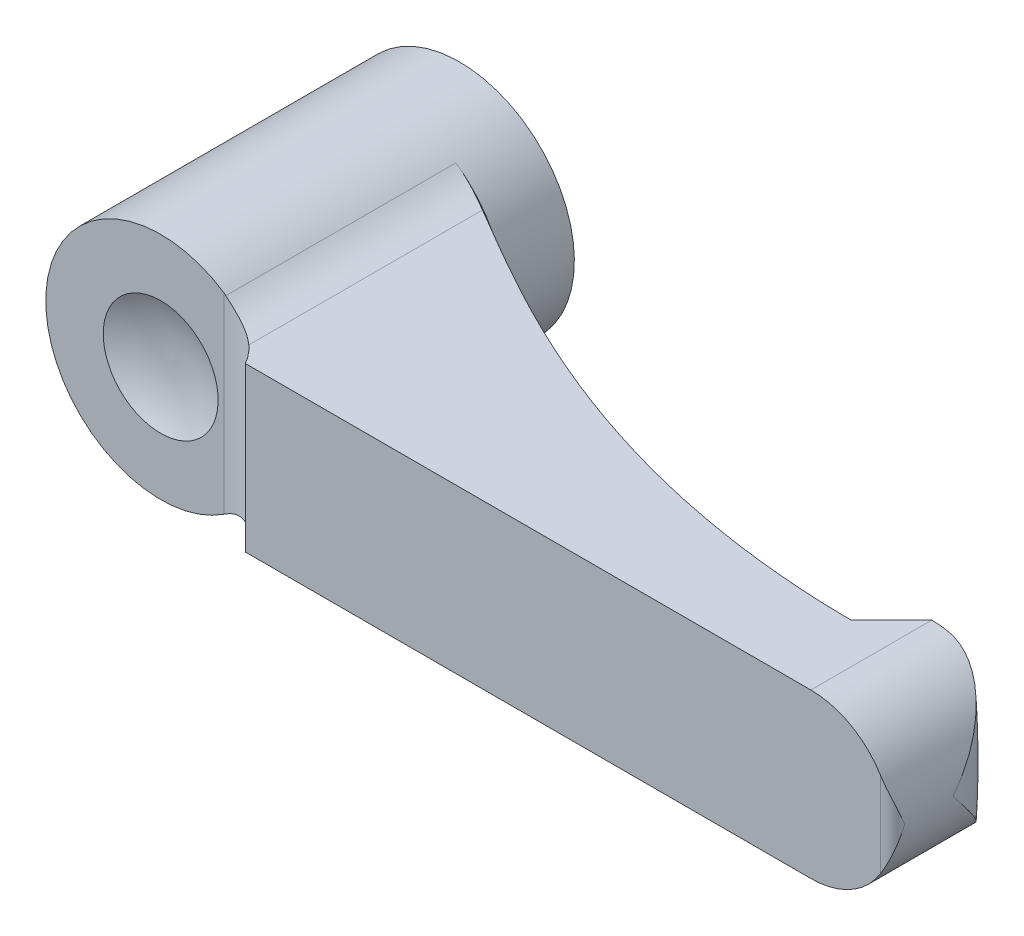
ISO-10303-21;
HEADER;
FILE_DESCRIPTION(('STEP AP214'),'2;1');
FILE_NAME('part.step','',(''),(''),'','','');
FILE_SCHEMA(('AUTOMOTIVE_DESIGN { 1 0 10303 214 1 1 1 1 }'));
ENDSEC;
DATA;
#1=APPLICATION_CONTEXT('core data for automotive mechanical design processes');
#2=APPLICATION_PROTOCOL_DEFINITION('international standard','automotive_design',2000,#1);
#3=PRODUCT_CONTEXT('',#1,'mechanical');
#4=PRODUCT('Part','Part','',(#3));
#5=PRODUCT_RELATED_PRODUCT_CATEGORY('part','',(#4));
#6=PRODUCT_DEFINITION_FORMATION('','',#4);
#7=PRODUCT_DEFINITION_CONTEXT('part definition',#1,'design');
#8=PRODUCT_DEFINITION('design','',#6,#7);
#9=PRODUCT_DEFINITION_SHAPE('','',#8);
#10=(LENGTH_UNIT() NAMED_UNIT(*) SI_UNIT(.MILLI.,.METRE.));
#11=(NAMED_UNIT(*) PLANE_ANGLE_UNIT() SI_UNIT($,.RADIAN.));
#12=(NAMED_UNIT(*) SI_UNIT($,.STERADIAN.) SOLID_ANGLE_UNIT());
#13=UNCERTAINTY_MEASURE_WITH_UNIT(LENGTH_MEASURE(1.E-05),#10,'distance_accuracy_value','');
#14=(GEOMETRIC_REPRESENTATION_CONTEXT(3) GLOBAL_UNCERTAINTY_ASSIGNED_CONTEXT((#13)) GLOBAL_UNIT_ASSIGNED_CONTEXT((#10,
#11,#12)) REPRESENTATION_CONTEXT('',''));
#15=CARTESIAN_POINT('',(0.,0.,0.));
#16=DIRECTION('',(0.,0.,1.));
#17=DIRECTION('',(1.,0.,0.));
#18=AXIS2_PLACEMENT_3D('',#15,#16,#17);
#19=CARTESIAN_POINT('',(56.25,0.,0.));
#20=DIRECTION('',(0.,0.,1.));
#21=DIRECTION('',(0.,-1.,0.));
#22=AXIS2_PLACEMENT_3D('',#19,#20,#21);
#23=CYLINDRICAL_SURFACE('',#22,6.75);
#24=CARTESIAN_POINT('',(63.0000000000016,0.,22.9999999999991));
#25=CARTESIAN_POINT('',(63.0000000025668,-0.00449405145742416,22.9963434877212));
#26=CARTESIAN_POINT('',(62.9999955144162,-0.00898821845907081,22.9926868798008));
#27=CARTESIAN_POINT('',(62.9990295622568,-0.492454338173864,22.5993222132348));
#28=CARTESIAN_POINT('',(62.9470606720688,-0.972658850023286,22.2086004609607));
#29=CARTESIAN_POINT('',(62.7913590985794,-1.68293621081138,21.6318928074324));
#30=CARTESIAN_POINT('',(62.7263122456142,-1.91844017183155,21.4408828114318));
#31=CARTESIAN_POINT('',(62.5695954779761,-2.38443626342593,21.063639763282));
#32=CARTESIAN_POINT('',(62.4779383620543,-2.61493074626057,20.8774044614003));
#33=CARTESIAN_POINT('',(62.2934553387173,-3.0123915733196,20.5572576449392));
#34=CARTESIAN_POINT('',(62.2065728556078,-3.1809188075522,20.421838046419));
#35=CARTESIAN_POINT('',(62.0170314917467,-3.51289184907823,20.1559922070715));
#36=CARTESIAN_POINT('',(61.9143726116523,-3.6763376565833,20.0255659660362));
#37=CARTESIAN_POINT('',(61.5824383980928,-4.15677568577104,19.6440366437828));
#38=CARTESIAN_POINT('',(61.3287574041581,-4.46485752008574,19.4018831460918));
#39=CARTESIAN_POINT('',(60.8284121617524,-4.96912949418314,19.0136337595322));
#40=CARTESIAN_POINT('',(60.5968353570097,-5.1736760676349,18.8588764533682));
#41=CARTESIAN_POINT('',(60.0965103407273,-5.55568025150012,18.5785040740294));
#42=CARTESIAN_POINT('',(59.8278138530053,-5.73317484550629,18.4528490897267));
#43=CARTESIAN_POINT('',(59.3159701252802,-6.01905814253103,18.2634976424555));
#44=CARTESIAN_POINT('',(59.0793963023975,-6.13412584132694,18.1923220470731));
#45=CARTESIAN_POINT('',(58.7110846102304,-6.28675625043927,18.1087014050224));
#46=CARTESIAN_POINT('',(58.5860152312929,-6.33432077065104,18.0846796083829));
#47=CARTESIAN_POINT('',(58.332033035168,-6.42227946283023,18.0451340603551));
#48=CARTESIAN_POINT('',(58.2031203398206,-6.46267386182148,18.0296100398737));
#49=CARTESIAN_POINT('',(57.9411238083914,-6.53615248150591,18.0077187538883));
#50=CARTESIAN_POINT('',(57.808012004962,-6.56916372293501,18.0014397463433));
#51=CARTESIAN_POINT('',(57.5399365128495,-6.6270171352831,17.9990012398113));
#52=CARTESIAN_POINT('',(57.4049731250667,-6.65186061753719,18.0028401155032));
#53=CARTESIAN_POINT('',(57.1348207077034,-6.69314748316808,18.0211370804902));
#54=CARTESIAN_POINT('',(56.9996330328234,-6.70961122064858,18.0355692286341));
#55=CARTESIAN_POINT('',(56.7301870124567,-6.73425513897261,18.0753366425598));
#56=CARTESIAN_POINT('',(56.595927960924,-6.74244251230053,18.1006624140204));
#57=CARTESIAN_POINT('',(56.4271627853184,-6.74776972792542,18.1397214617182));
#58=CARTESIAN_POINT('',(56.3915323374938,-6.74860980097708,18.1483819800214));
#59=CARTESIAN_POINT('',(56.320500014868,-6.74972499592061,18.1664807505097));
#60=CARTESIAN_POINT('',(56.2850979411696,-6.75000070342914,18.1759181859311));
#61=CARTESIAN_POINT('',(56.2498,-6.74999999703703,18.1857479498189));
#62=B_SPLINE_CURVE_WITH_KNOTS('',3,(#24,#25,#26,#27,#28,#29,#30,#31,#32,#33,#34,#35,#36,#37,#38,
#39,#40,#41,#42,#43,#44,#45,#46,#47,#48,#49,#50,#51,#52,#53,#54,#55,#56,#57,#58,#59,#60,#61),
.UNSPECIFIED.,.F.,.F.,(4,2,2,2,2,2,2,2,2,2,2,2,2,2,2,2,2,2,4),(0.,0.017381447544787,
1.86978767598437,2.79935621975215,3.72847840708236,4.4268540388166,5.12522964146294,
6.51797465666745,7.55125947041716,8.58311872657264,9.3972360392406,9.80464714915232,
10.2120453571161,10.6233081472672,11.0345048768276,11.4446979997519,11.8545343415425,
11.9645585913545,12.0744686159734),.UNSPECIFIED.);
#63=CARTESIAN_POINT('',(57.6255506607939,-6.60835534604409,18.));
#64=VERTEX_POINT('',#63);
#65=CARTESIAN_POINT('',(63.,0.,23.));
#66=VERTEX_POINT('',#65);
#67=EDGE_CURVE('E380',#64,#66,#62,.F.);
#68=ORIENTED_EDGE('',*,*,#67,.T.);
#69=CARTESIAN_POINT('',(63.0000000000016,0.,22.9999999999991));
#70=CARTESIAN_POINT('',(63.0000000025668,0.00449405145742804,22.9963434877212));
#71=CARTESIAN_POINT('',(62.9999955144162,0.00898821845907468,22.9926868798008));
#72=CARTESIAN_POINT('',(62.9990295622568,0.492454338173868,22.5993222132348));
#73=CARTESIAN_POINT('',(62.9470606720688,0.97265885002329,22.2086004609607));
#74=CARTESIAN_POINT('',(62.7913590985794,1.68293621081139,21.6318928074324));
#75=CARTESIAN_POINT('',(62.7263122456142,1.91844017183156,21.4408828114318));
#76=CARTESIAN_POINT('',(62.5695954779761,2.38443626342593,21.063639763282));
#77=CARTESIAN_POINT('',(62.4779383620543,2.61493074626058,20.8774044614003));
#78=CARTESIAN_POINT('',(62.2934553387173,3.01239157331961,20.5572576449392));
#79=CARTESIAN_POINT('',(62.2065728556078,3.1809188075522,20.421838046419));
#80=CARTESIAN_POINT('',(62.0170314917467,3.51289184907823,20.1559922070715));
#81=CARTESIAN_POINT('',(61.9143726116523,3.6763376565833,20.0255659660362));
#82=CARTESIAN_POINT('',(61.5824383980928,4.15677568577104,19.6440366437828));
#83=CARTESIAN_POINT('',(61.3287574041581,4.46485752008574,19.4018831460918));
#84=CARTESIAN_POINT('',(60.8284121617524,4.96912949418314,19.0136337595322));
#85=CARTESIAN_POINT('',(60.5968353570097,5.1736760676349,18.8588764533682));
#86=CARTESIAN_POINT('',(60.0965103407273,5.55568025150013,18.5785040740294));
#87=CARTESIAN_POINT('',(59.8278138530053,5.7331748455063,18.4528490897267));
#88=CARTESIAN_POINT('',(59.3159701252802,6.01905814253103,18.2634976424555));
#89=CARTESIAN_POINT('',(59.0793963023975,6.13412584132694,18.1923220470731));
#90=CARTESIAN_POINT('',(58.7110846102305,6.28675625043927,18.1087014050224));
#91=CARTESIAN_POINT('',(58.5860152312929,6.33432077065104,18.0846796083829));
#92=CARTESIAN_POINT('',(58.332033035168,6.42227946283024,18.0451340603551));
#93=CARTESIAN_POINT('',(58.2031203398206,6.46267386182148,18.0296100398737));
#94=CARTESIAN_POINT('',(57.9411238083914,6.53615248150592,18.0077187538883));
#95=CARTESIAN_POINT('',(57.808012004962,6.56916372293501,18.0014397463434));
#96=CARTESIAN_POINT('',(57.5399365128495,6.6270171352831,17.9990012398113));
#97=CARTESIAN_POINT('',(57.4049731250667,6.65186061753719,18.0028401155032));
#98=CARTESIAN_POINT('',(57.1348207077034,6.69314748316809,18.0211370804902));
#99=CARTESIAN_POINT('',(56.9996330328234,6.70961122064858,18.0355692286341));
#100=CARTESIAN_POINT('',(56.7301870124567,6.73425513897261,18.0753366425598));
#101=CARTESIAN_POINT('',(56.595927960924,6.74244251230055,18.1006624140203));
#102=CARTESIAN_POINT('',(56.4271627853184,6.74776972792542,18.1397214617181));
#103=CARTESIAN_POINT('',(56.3915323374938,6.74860980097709,18.1483819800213));
#104=CARTESIAN_POINT('',(56.320500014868,6.74972499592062,18.1664807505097));
#105=CARTESIAN_POINT('',(56.2850979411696,6.75000070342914,18.1759181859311));
#106=CARTESIAN_POINT('',(56.2498,6.74999999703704,18.1857479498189));
#107=B_SPLINE_CURVE_WITH_KNOTS('',3,(#69,#70,#71,#72,#73,#74,#75,#76,#77,#78,#79,#80,#81,#82,
#83,#84,#85,#86,#87,#88,#89,#90,#91,#92,#93,#94,#95,#96,#97,#98,#99,#100,#101,#102,#103,#104,
#105,#106),.UNSPECIFIED.,.F.,.F.,(4,2,2,2,2,2,2,2,2,2,2,2,2,2,2,2,2,2,4),(0.,0.017381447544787,
1.86978767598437,2.79935621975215,3.72847840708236,4.4268540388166,5.12522964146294,
6.51797465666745,7.55125947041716,8.58311872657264,9.39723603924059,9.80464714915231,
10.2120453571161,10.6233081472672,11.0345048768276,11.4446979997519,11.8545343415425,
11.9645585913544,12.0744686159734),.UNSPECIFIED.);
#108=CARTESIAN_POINT('',(57.6255506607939,6.60835534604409,18.));
#109=VERTEX_POINT('',#108);
#110=EDGE_CURVE('E164',#66,#109,#107,.T.);
#111=ORIENTED_EDGE('',*,*,#110,.T.);
#112=CARTESIAN_POINT('',(56.25,0.,18.));
#113=DIRECTION('',(0.,0.,-1.));
#114=DIRECTION('',(0.,1.,0.));
#115=AXIS2_PLACEMENT_3D('',#112,#113,#114);
#116=CIRCLE('',#115,6.75);
#117=CARTESIAN_POINT('',(56.25,6.75,18.));
#118=VERTEX_POINT('',#117);
#119=EDGE_CURVE('E362',#109,#118,#116,.F.);
#120=ORIENTED_EDGE('',*,*,#119,.T.);
#121=DIRECTION('',(0.,0.,1.));
#122=VECTOR('',#121,1.);
#123=CARTESIAN_POINT('',(56.25,6.75,0.));
#124=LINE('',#123,#122);
#125=CARTESIAN_POINT('',(56.25,6.75,28.));
#126=VERTEX_POINT('',#125);
#127=EDGE_CURVE('E332',#118,#126,#124,.T.);
#128=ORIENTED_EDGE('',*,*,#127,.T.);
#129=CARTESIAN_POINT('',(56.25,0.,28.));
#130=DIRECTION('',(0.,0.,1.));
#131=DIRECTION('',(0.,-1.,0.));
#132=AXIS2_PLACEMENT_3D('',#129,#130,#131);
#133=CIRCLE('',#132,6.75);
#134=CARTESIAN_POINT('',(62.,3.53553390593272,28.));
#135=VERTEX_POINT('',#134);
#136=EDGE_CURVE('E349',#135,#126,#133,.T.);
#137=ORIENTED_EDGE('',*,*,#136,.F.);
#138=CARTESIAN_POINT('',(62.,3.53553390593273,28.));
#139=CARTESIAN_POINT('',(62.0299932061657,3.48675666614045,27.9999933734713));
#140=CARTESIAN_POINT('',(62.0593538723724,3.4376127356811,27.9986515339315));
#141=CARTESIAN_POINT('',(62.1167538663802,3.3387069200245,27.9935798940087));
#142=CARTESIAN_POINT('',(62.144793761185,3.28894531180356,27.9898511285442));
#143=CARTESIAN_POINT('',(62.2267562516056,3.13908056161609,27.9755285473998));
#144=CARTESIAN_POINT('',(62.2786643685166,3.03816514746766,27.9617957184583));
#145=CARTESIAN_POINT('',(62.3766467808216,2.83536966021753,27.9277987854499));
#146=CARTESIAN_POINT('',(62.4227515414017,2.73349792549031,27.907570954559));
#147=CARTESIAN_POINT('',(62.5095025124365,2.52854152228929,27.8618646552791));
#148=CARTESIAN_POINT('',(62.5501444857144,2.42545597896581,27.8363821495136));
#149=CARTESIAN_POINT('',(62.6493297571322,2.15471359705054,27.7642737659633));
#150=CARTESIAN_POINT('',(62.7035065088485,1.98634279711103,27.7142841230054));
#151=CARTESIAN_POINT('',(62.7980553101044,1.64812969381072,27.6068184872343));
#152=CARTESIAN_POINT('',(62.8384218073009,1.47828682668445,27.5493394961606));
#153=CARTESIAN_POINT('',(62.9057483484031,1.13742664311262,27.4293690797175));
#154=CARTESIAN_POINT('',(62.9326868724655,0.966407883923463,27.3668697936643));
#155=CARTESIAN_POINT('',(62.9733111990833,0.623942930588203,27.239076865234));
#156=CARTESIAN_POINT('',(62.9870036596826,0.452496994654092,27.1737846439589));
#157=CARTESIAN_POINT('',(62.9978376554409,0.192449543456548,27.0740662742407));
#158=CARTESIAN_POINT('',(62.999781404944,0.103891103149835,27.0399873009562));
#159=CARTESIAN_POINT('',(62.9999941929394,0.0102233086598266,27.0039349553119));
#160=CARTESIAN_POINT('',(62.9999999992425,0.005111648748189,27.0019674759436));
#161=CARTESIAN_POINT('',(63.,0.,27.0000000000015));
#162=B_SPLINE_CURVE_WITH_KNOTS('',3,(#138,#139,#140,#141,#142,#143,#144,#145,#146,#147,#148,
#149,#150,#151,#152,#153,#154,#155,#156,#157,#158,#159,#160,#161),.UNSPECIFIED.,.F.,.F.,(4,2,2,
2,2,2,2,2,2,2,2,4),(0.,0.171732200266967,0.343389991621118,0.68589070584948,1.0265109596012,
1.36739390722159,1.91796289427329,2.46875297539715,3.02042294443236,3.57181547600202,
3.85648313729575,3.87291482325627),.UNSPECIFIED.);
#163=CARTESIAN_POINT('',(63.,0.,27.0000000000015));
#164=VERTEX_POINT('',#163);
#165=EDGE_CURVE('E174',#164,#135,#162,.F.);
#166=ORIENTED_EDGE('',*,*,#165,.F.);
#167=CARTESIAN_POINT('',(62.,-3.53553390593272,28.));
#168=CARTESIAN_POINT('',(62.0299932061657,-3.48675666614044,27.9999933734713));
#169=CARTESIAN_POINT('',(62.0593538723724,-3.4376127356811,27.9986515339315));
#170=CARTESIAN_POINT('',(62.1167538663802,-3.33870692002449,27.9935798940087));
#171=CARTESIAN_POINT('',(62.144793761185,-3.28894531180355,27.9898511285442));
#172=CARTESIAN_POINT('',(62.2267562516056,-3.13908056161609,27.9755285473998));
#173=CARTESIAN_POINT('',(62.2786643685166,-3.03816514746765,27.9617957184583));
#174=CARTESIAN_POINT('',(62.3766467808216,-2.83536966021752,27.9277987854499));
#175=CARTESIAN_POINT('',(62.4227515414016,-2.7334979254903,27.907570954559));
#176=CARTESIAN_POINT('',(62.5095025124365,-2.52854152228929,27.8618646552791));
#177=CARTESIAN_POINT('',(62.5501444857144,-2.4254559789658,27.8363821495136));
#178=CARTESIAN_POINT('',(62.6493297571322,-2.15471359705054,27.7642737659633));
#179=CARTESIAN_POINT('',(62.7035065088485,-1.98634279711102,27.7142841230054));
#180=CARTESIAN_POINT('',(62.7980553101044,-1.64812969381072,27.6068184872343));
#181=CARTESIAN_POINT('',(62.8384218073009,-1.47828682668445,27.5493394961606));
#182=CARTESIAN_POINT('',(62.9057483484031,-1.13742664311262,27.4293690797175));
#183=CARTESIAN_POINT('',(62.9326868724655,-0.96640788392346,27.3668697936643));
#184=CARTESIAN_POINT('',(62.9733111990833,-0.623942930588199,27.239076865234));
#185=CARTESIAN_POINT('',(62.9870036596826,-0.452496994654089,27.1737846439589));
#186=CARTESIAN_POINT('',(62.9978376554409,-0.192449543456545,27.0740662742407));
#187=CARTESIAN_POINT('',(62.999781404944,-0.103891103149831,27.0399873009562));
#188=CARTESIAN_POINT('',(62.9999941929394,-0.0102233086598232,27.0039349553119));
#189=CARTESIAN_POINT('',(62.9999999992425,-0.00511164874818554,27.0019674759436));
#190=CARTESIAN_POINT('',(63.,0.,27.0000000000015));
#191=B_SPLINE_CURVE_WITH_KNOTS('',3,(#167,#168,#169,#170,#171,#172,#173,#174,#175,#176,#177,
#178,#179,#180,#181,#182,#183,#184,#185,#186,#187,#188,#189,#190),.UNSPECIFIED.,.F.,.F.,(4,2,2,
2,2,2,2,2,2,2,2,4),(0.,0.171732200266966,0.343389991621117,0.685890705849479,1.0265109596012,
1.36739390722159,1.91796289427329,2.46875297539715,3.02042294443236,3.57181547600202,
3.85648313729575,3.87291482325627),.UNSPECIFIED.);
#192=CARTESIAN_POINT('',(62.,-3.53553390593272,28.));
#193=VERTEX_POINT('',#192);
#194=EDGE_CURVE('E22',#193,#164,#191,.T.);
#195=ORIENTED_EDGE('',*,*,#194,.F.);
#196=CARTESIAN_POINT('',(56.25,-6.75,28.));
#197=VERTEX_POINT('',#196);
#198=EDGE_CURVE('E350',#197,#193,#133,.T.);
#199=ORIENTED_EDGE('',*,*,#198,.F.);
#200=DIRECTION('',(0.,0.,1.));
#201=VECTOR('',#200,1.);
#202=CARTESIAN_POINT('',(56.25,-6.75,0.));
#203=LINE('',#202,#201);
#204=CARTESIAN_POINT('',(56.25,-6.75,18.));
#205=VERTEX_POINT('',#204);
#206=EDGE_CURVE('E338',#205,#197,#203,.T.);
#207=ORIENTED_EDGE('',*,*,#206,.F.);
#208=EDGE_CURVE('E185',#205,#64,#116,.F.);
#209=ORIENTED_EDGE('',*,*,#208,.T.);
#210=EDGE_LOOP('',(#68,#111,#120,#128,#137,#166,#195,#199,#207,#209));
#211=FACE_BOUND('',#210,.T.);
#212=ADVANCED_FACE('F14',(#211),#23,.T.);
#213=CARTESIAN_POINT('',(54.2774302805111,-13.5,-51.6539828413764));
#214=DIRECTION('',(0.,1.,0.));
#215=DIRECTION('',(-1.,0.,0.));
#216=AXIS2_PLACEMENT_3D('',#213,#214,#215);
#217=CYLINDRICAL_SURFACE('',#216,72.9999999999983);
#218=CARTESIAN_POINT('',(52.3128476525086,8.1002,21.3195768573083));
#219=CARTESIAN_POINT('',(52.4131897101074,7.42828656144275,21.3222651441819));
#220=CARTESIAN_POINT('',(52.5012129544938,6.75452314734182,21.324440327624));
#221=CARTESIAN_POINT('',(52.6523237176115,5.40419146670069,21.3279687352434));
#222=CARTESIAN_POINT('',(52.7154107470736,4.72762314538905,21.3293219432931));
#223=CARTESIAN_POINT('',(52.8160690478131,3.37633482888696,21.3314048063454));
#224=CARTESIAN_POINT('',(52.8537789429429,2.70162517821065,21.3321378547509));
#225=CARTESIAN_POINT('',(52.9040776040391,1.35127701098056,21.3331021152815));
#226=CARTESIAN_POINT('',(52.916666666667,0.675638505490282,21.333333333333));
#227=CARTESIAN_POINT('',(52.916666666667,-0.675638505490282,21.333333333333));
#228=CARTESIAN_POINT('',(52.9040776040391,-1.35127701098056,21.3331021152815));
#229=CARTESIAN_POINT('',(52.8537789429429,-2.70162517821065,21.3321378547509));
#230=CARTESIAN_POINT('',(52.8160690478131,-3.37633482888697,21.3314048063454));
#231=CARTESIAN_POINT('',(52.7154107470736,-4.72762314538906,21.3293219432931));
#232=CARTESIAN_POINT('',(52.6523237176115,-5.40419146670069,21.3279687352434));
#233=CARTESIAN_POINT('',(52.5012129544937,-6.75452314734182,21.324440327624));
#234=CARTESIAN_POINT('',(52.4131897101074,-7.42828656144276,21.3222651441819));
#235=CARTESIAN_POINT('',(52.3128476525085,-8.1002,21.3195768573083));
#236=B_SPLINE_CURVE_WITH_KNOTS('',3,(#218,#219,#220,#221,#222,#223,#224,#225,#226,#227,#228,
#229,#230,#231,#232,#233,#234,#235),.UNSPECIFIED.,.F.,.F.,(4,2,2,2,2,2,2,2,4),(0.,
2.03800787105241,4.07605572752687,6.10287826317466,8.12967686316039,10.1564754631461,
12.1832979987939,14.2213458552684,16.2593537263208),.UNSPECIFIED.);
#237=CARTESIAN_POINT('',(52.4975588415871,6.75,21.3243156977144));
#238=VERTEX_POINT('',#237);
#239=CARTESIAN_POINT('',(52.916666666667,0.,21.333333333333));
#240=VERTEX_POINT('',#239);
#241=EDGE_CURVE('E290',#238,#240,#236,.T.);
#242=ORIENTED_EDGE('',*,*,#241,.F.);
#243=CARTESIAN_POINT('',(54.2774302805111,6.75,-51.6539828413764));
#244=DIRECTION('',(0.,-1.,0.));
#245=DIRECTION('',(1.,0.,0.));
#246=AXIS2_PLACEMENT_3D('',#243,#244,#245);
#247=CIRCLE('',#246,72.9999999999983);
#248=CARTESIAN_POINT('',(52.916666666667,6.75,21.333333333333));
#249=VERTEX_POINT('',#248);
#250=EDGE_CURVE('E328',#238,#249,#247,.F.);
#251=ORIENTED_EDGE('',*,*,#250,.T.);
#252=DIRECTION('',(0.,1.,0.));
#253=VECTOR('',#252,1.);
#254=CARTESIAN_POINT('',(52.916666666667,-13.5,21.333333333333));
#255=LINE('',#254,#253);
#256=EDGE_CURVE('E254',#240,#249,#255,.T.);
#257=ORIENTED_EDGE('',*,*,#256,.F.);
#258=EDGE_LOOP('',(#242,#251,#257));
#259=FACE_BOUND('',#258,.T.);
#260=ADVANCED_FACE('F141',(#259),#217,.F.);
#261=CARTESIAN_POINT('',(58.,-13.5,18.));
#262=DIRECTION('',(0.,0.,-1.));
#263=DIRECTION('',(0.,1.,0.));
#264=AXIS2_PLACEMENT_3D('',#261,#262,#263);
#265=PLANE('',#264);
#266=ORIENTED_EDGE('',*,*,#119,.F.);
#267=CARTESIAN_POINT('',(-0.5,0.,18.));
#268=DIRECTION('',(0.,0.,-1.));
#269=DIRECTION('',(0.,1.,0.));
#270=AXIS2_PLACEMENT_3D('',#267,#268,#269);
#271=CIRCLE('',#270,58.5000000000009);
#272=EDGE_CURVE('E37',#109,#64,#271,.T.);
#273=ORIENTED_EDGE('',*,*,#272,.T.);
#274=ORIENTED_EDGE('',*,*,#208,.F.);
#275=DIRECTION('',(0.,1.,0.));
#276=VECTOR('',#275,1.);
#277=CARTESIAN_POINT('',(56.25,-13.5,18.));
#278=LINE('',#277,#276);
#279=EDGE_CURVE('E323',#205,#118,#278,.T.);
#280=ORIENTED_EDGE('',*,*,#279,.T.);
#281=EDGE_LOOP('',(#266,#273,#274,#280));
#282=FACE_BOUND('',#281,.T.);
#283=ADVANCED_FACE('F147',(#282),#265,.T.);
#284=CARTESIAN_POINT('',(0.,0.,28.));
#285=DIRECTION('',(0.,0.,1.));
#286=DIRECTION('',(0.,-1.,0.));
#287=AXIS2_PLACEMENT_3D('',#284,#285,#286);
#288=PLANE('',#287);
#289=DIRECTION('',(1.,0.,0.));
#290=VECTOR('',#289,1.);
#291=CARTESIAN_POINT('',(8.3140512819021,6.75,28.));
#292=LINE('',#291,#290);
#293=CARTESIAN_POINT('',(9.5,6.75,28.));
#294=VERTEX_POINT('',#293);
#295=EDGE_CURVE('E327',#294,#126,#292,.T.);
#296=ORIENTED_EDGE('',*,*,#295,.F.);
#297=DIRECTION('',(0.,1.,0.));
#298=VECTOR('',#297,1.);
#299=CARTESIAN_POINT('',(9.5,-13.5,28.));
#300=LINE('',#299,#298);
#301=CARTESIAN_POINT('',(9.5,-6.75,28.));
#302=VERTEX_POINT('',#301);
#303=EDGE_CURVE('E386',#302,#294,#300,.T.);
#304=ORIENTED_EDGE('',*,*,#303,.F.);
#305=DIRECTION('',(-1.,0.,0.));
#306=VECTOR('',#305,1.);
#307=CARTESIAN_POINT('',(56.25,-6.75,28.));
#308=LINE('',#307,#306);
#309=EDGE_CURVE('E407',#197,#302,#308,.T.);
#310=ORIENTED_EDGE('',*,*,#309,.F.);
#311=ORIENTED_EDGE('',*,*,#198,.T.);
#312=DIRECTION('',(0.,1.,0.));
#313=VECTOR('',#312,1.);
#314=CARTESIAN_POINT('',(62.,-13.5,28.));
#315=LINE('',#314,#313);
#316=EDGE_CURVE('E359',#193,#135,#315,.T.);
#317=ORIENTED_EDGE('',*,*,#316,.T.);
#318=ORIENTED_EDGE('',*,*,#136,.T.);
#319=EDGE_LOOP('',(#296,#304,#310,#311,#317,#318));
#320=FACE_BOUND('',#319,.T.);
#321=ADVANCED_FACE('F242',(#320),#288,.T.);
#322=CARTESIAN_POINT('',(-0.5,0.,0.));
#323=DIRECTION('',(0.,0.,-1.));
#324=DIRECTION('',(0.,1.,0.));
#325=AXIS2_PLACEMENT_3D('',#322,#323,#324);
#326=CYLINDRICAL_SURFACE('',#325,9.5);
#327=CARTESIAN_POINT('',(-0.5,0.,0.3));
#328=DIRECTION('',(0.,0.,1.));
#329=DIRECTION('',(0.,-1.,0.));
#330=AXIS2_PLACEMENT_3D('',#327,#328,#329);
#331=CIRCLE('',#330,9.5);
#332=CARTESIAN_POINT('',(-0.5,-9.5,0.3));
#333=VERTEX_POINT('',#332);
#334=EDGE_CURVE('E9',#333,#333,#331,.T.);
#335=ORIENTED_EDGE('',*,*,#334,.T.);
#336=EDGE_LOOP('',(#335));
#337=FACE_BOUND('',#336,.T.);
#338=CARTESIAN_POINT('',(-0.5,0.,6.));
#339=DIRECTION('',(0.,0.,-1.));
#340=DIRECTION('',(0.,1.,0.));
#341=AXIS2_PLACEMENT_3D('',#338,#339,#340);
#342=CIRCLE('',#341,9.5);
#343=CARTESIAN_POINT('',(4.9021604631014,7.81451612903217,6.));
#344=VERTEX_POINT('',#343);
#345=CARTESIAN_POINT('',(4.90216046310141,-7.81451612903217,6.));
#346=VERTEX_POINT('',#345);
#347=EDGE_CURVE('E373',#344,#346,#342,.T.);
#348=ORIENTED_EDGE('',*,*,#347,.T.);
#349=DIRECTION('',(0.,0.,1.));
#350=VECTOR('',#349,1.);
#351=CARTESIAN_POINT('',(4.9021604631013,-7.8145161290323,0.));
#352=LINE('',#351,#350);
#353=CARTESIAN_POINT('',(4.9021604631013,-7.8145161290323,25.0135516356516));
#354=VERTEX_POINT('',#353);
#355=EDGE_CURVE('E410',#346,#354,#352,.T.);
#356=ORIENTED_EDGE('',*,*,#355,.T.);
#357=CARTESIAN_POINT('',(4.75,-7.91754381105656,25.));
#358=CARTESIAN_POINT('',(4.77554501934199,-7.90060503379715,25.0019496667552));
#359=CARTESIAN_POINT('',(4.80099756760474,-7.88355000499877,25.0040538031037));
#360=CARTESIAN_POINT('',(4.85171772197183,-7.84920744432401,25.0085710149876));
#361=CARTESIAN_POINT('',(4.87698532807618,-7.83191991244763,25.0109840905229));
#362=CARTESIAN_POINT('',(4.90216046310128,-7.81451612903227,25.0135516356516));
#363=B_SPLINE_CURVE_WITH_KNOTS('',3,(#357,#358,#359,#360,#361,#362),.UNSPECIFIED.,.F.,.F.,(4,2,
4),(0.,0.0921314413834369,0.184262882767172),.UNSPECIFIED.);
#364=CARTESIAN_POINT('',(4.75,-7.91754381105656,25.));
#365=VERTEX_POINT('',#364);
#366=EDGE_CURVE('E215',#365,#354,#363,.T.);
#367=ORIENTED_EDGE('',*,*,#366,.F.);
#368=CARTESIAN_POINT('',(-0.5,0.,25.));
#369=DIRECTION('',(0.,0.,-1.));
#370=DIRECTION('',(0.,1.,0.));
#371=AXIS2_PLACEMENT_3D('',#368,#369,#370);
#372=CIRCLE('',#371,9.5);
#373=CARTESIAN_POINT('',(4.75,7.91754381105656,25.));
#374=VERTEX_POINT('',#373);
#375=EDGE_CURVE('E347',#365,#374,#372,.T.);
#376=ORIENTED_EDGE('',*,*,#375,.T.);
#377=CARTESIAN_POINT('',(4.90216046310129,7.81451612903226,25.0135516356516));
#378=CARTESIAN_POINT('',(4.87698532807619,7.83191991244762,25.0109840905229));
#379=CARTESIAN_POINT('',(4.85171772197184,7.849207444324,25.0085710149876));
#380=CARTESIAN_POINT('',(4.80099756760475,7.88355000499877,25.0040538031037));
#381=CARTESIAN_POINT('',(4.77554501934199,7.90060503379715,25.0019496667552));
#382=CARTESIAN_POINT('',(4.75,7.91754381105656,25.));
#383=B_SPLINE_CURVE_WITH_KNOTS('',3,(#377,#378,#379,#380,#381,#382),.UNSPECIFIED.,.F.,.F.,(4,2,
4),(0.,0.0921314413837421,0.184262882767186),.UNSPECIFIED.);
#384=CARTESIAN_POINT('',(4.9021604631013,7.8145161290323,25.0135516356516));
#385=VERTEX_POINT('',#384);
#386=EDGE_CURVE('E229',#385,#374,#383,.T.);
#387=ORIENTED_EDGE('',*,*,#386,.F.);
#388=DIRECTION('',(0.,0.,1.));
#389=VECTOR('',#388,1.);
#390=CARTESIAN_POINT('',(4.9021604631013,7.8145161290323,0.));
#391=LINE('',#390,#389);
#392=EDGE_CURVE('E340',#344,#385,#391,.T.);
#393=ORIENTED_EDGE('',*,*,#392,.F.);
#394=EDGE_LOOP('',(#348,#356,#367,#376,#387,#393));
#395=FACE_BOUND('',#394,.T.);
#396=ADVANCED_FACE('F240',(#337,#395),#326,.T.);
#397=CARTESIAN_POINT('',(8.31405128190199,12.7499999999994,0.));
#398=DIRECTION('',(0.,0.,1.));
#399=DIRECTION('',(0.,-1.,0.));
#400=AXIS2_PLACEMENT_3D('',#397,#398,#399);
#401=CYLINDRICAL_SURFACE('',#400,5.99999999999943);
#402=DIRECTION('',(0.,0.,1.));
#403=VECTOR('',#402,1.);
#404=CARTESIAN_POINT('',(8.31405128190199,6.75,0.));
#405=LINE('',#404,#403);
#406=CARTESIAN_POINT('',(8.31405128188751,6.75,7.20869247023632));
#407=VERTEX_POINT('',#406);
#408=CARTESIAN_POINT('',(8.31405128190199,6.75,26.5286412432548));
#409=VERTEX_POINT('',#408);
#410=EDGE_CURVE('E337',#407,#409,#405,.T.);
#411=ORIENTED_EDGE('',*,*,#410,.F.);
#412=CARTESIAN_POINT('',(8.314251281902,6.75000000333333,7.20880889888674));
#413=CARTESIAN_POINT('',(8.1854499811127,6.75000978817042,7.13385649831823));
#414=CARTESIAN_POINT('',(8.05574357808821,6.75414053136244,7.06036717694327));
#415=CARTESIAN_POINT('',(7.79450788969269,6.77109651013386,6.91724572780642));
#416=CARTESIAN_POINT('',(7.66297592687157,6.78393622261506,6.84762023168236));
#417=CARTESIAN_POINT('',(7.39667564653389,6.81900682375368,6.71248492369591));
#418=CARTESIAN_POINT('',(7.26188773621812,6.84136531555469,6.64704546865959));
#419=CARTESIAN_POINT('',(6.99139798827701,6.89597151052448,6.52280692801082));
#420=CARTESIAN_POINT('',(6.85569680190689,6.9282127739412,6.46400355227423));
#421=CARTESIAN_POINT('',(6.50422295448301,7.02511420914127,6.32258928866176));
#422=CARTESIAN_POINT('',(6.28795071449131,7.09771225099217,6.24611887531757));
#423=CARTESIAN_POINT('',(5.96665490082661,7.22704821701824,6.15260738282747));
#424=CARTESIAN_POINT('',(5.86039071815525,7.27339654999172,6.12502082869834));
#425=CARTESIAN_POINT('',(5.6493587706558,7.37291919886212,6.0775890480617));
#426=CARTESIAN_POINT('',(5.54459023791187,7.42608986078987,6.05773970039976));
#427=CARTESIAN_POINT('',(5.34902156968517,7.53276252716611,6.02824703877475));
#428=CARTESIAN_POINT('',(5.25797135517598,7.58556023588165,6.01770953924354));
#429=CARTESIAN_POINT('',(5.07806250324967,7.69632487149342,6.00355247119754));
#430=CARTESIAN_POINT('',(4.98921299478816,7.75430982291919,5.99995808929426));
#431=CARTESIAN_POINT('',(4.9019604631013,7.81465439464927,6.00000000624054));
#432=B_SPLINE_CURVE_WITH_KNOTS('',3,(#412,#413,#414,#415,#416,#417,#418,#419,#420,#421,#422,
#423,#424,#425,#426,#427,#428,#429,#430,#431),.UNSPECIFIED.,.F.,.F.,(4,2,2,2,2,2,2,2,2,4),(0.,
0.447065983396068,0.894876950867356,1.34889001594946,1.80260786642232,2.52118384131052,
2.87832524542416,3.23527616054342,3.55224237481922,3.8703562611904),.UNSPECIFIED.);
#433=EDGE_CURVE('E246',#407,#344,#432,.T.);
#434=ORIENTED_EDGE('',*,*,#433,.T.);
#435=ORIENTED_EDGE('',*,*,#392,.T.);
#436=CARTESIAN_POINT('',(8.31405128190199,6.75,26.5286412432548));
#437=CARTESIAN_POINT('',(8.21611424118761,6.7499905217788,26.4402150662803));
#438=CARTESIAN_POINT('',(8.11520843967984,6.75239786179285,26.3550277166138));
#439=CARTESIAN_POINT('',(7.90813078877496,6.76285094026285,26.1915611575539));
#440=CARTESIAN_POINT('',(7.80195572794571,6.77090015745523,26.1132862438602));
#441=CARTESIAN_POINT('',(7.58511460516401,6.79344573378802,25.9641722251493));
#442=CARTESIAN_POINT('',(7.47444775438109,6.80794322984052,25.8933344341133));
#443=CARTESIAN_POINT('',(7.24959934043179,6.84407918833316,25.759541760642));
#444=CARTESIAN_POINT('',(7.13541864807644,6.86571589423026,25.6965849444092));
#445=CARTESIAN_POINT('',(6.90402450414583,6.9168252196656,25.5785641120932));
#446=CARTESIAN_POINT('',(6.78679909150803,6.94633508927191,25.5235395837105));
#447=CARTESIAN_POINT('',(6.55105235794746,7.01355019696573,25.4219202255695));
#448=CARTESIAN_POINT('',(6.43253108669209,7.05125512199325,25.3753250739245));
#449=CARTESIAN_POINT('',(6.19565405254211,7.13500718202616,25.2906262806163));
#450=CARTESIAN_POINT('',(6.07729835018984,7.18104004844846,25.2525083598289));
#451=CARTESIAN_POINT('',(5.84185117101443,7.28148917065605,25.1844689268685));
#452=CARTESIAN_POINT('',(5.72475926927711,7.33590250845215,25.1545445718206));
#453=CARTESIAN_POINT('',(5.48760207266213,7.45569981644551,25.1012746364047));
#454=CARTESIAN_POINT('',(5.36765221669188,7.52147665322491,25.0783002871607));
#455=CARTESIAN_POINT('',(5.13167917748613,7.66163603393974,25.0402111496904));
#456=CARTESIAN_POINT('',(5.01565387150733,7.73601382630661,25.0250920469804));
#457=CARTESIAN_POINT('',(4.9021604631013,7.8145161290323,25.0135516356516));
#458=B_SPLINE_CURVE_WITH_KNOTS('',3,(#436,#437,#438,#439,#440,#441,#442,#443,#444,#445,#446,
#447,#448,#449,#450,#451,#452,#453,#454,#455,#456,#457),.UNSPECIFIED.,.F.,.F.,(4,2,2,2,2,2,2,2,
2,2,4),(0.,0.395806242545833,0.791856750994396,1.18797711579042,1.58400009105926,
1.9819310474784,2.37984680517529,2.77708714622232,3.17418948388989,3.58978312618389,
4.00514826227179),.UNSPECIFIED.);
#459=EDGE_CURVE('E223',#409,#385,#458,.T.);
#460=ORIENTED_EDGE('',*,*,#459,.F.);
#461=EDGE_LOOP('',(#411,#434,#435,#460));
#462=FACE_BOUND('',#461,.T.);
#463=ADVANCED_FACE('F236',(#462),#401,.F.);
#464=CARTESIAN_POINT('',(8.3140512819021,6.75,0.));
#465=DIRECTION('',(0.,-1.,0.));
#466=DIRECTION('',(1.,0.,0.));
#467=AXIS2_PLACEMENT_3D('',#464,#465,#466);
#468=PLANE('',#467);
#469=ORIENTED_EDGE('',*,*,#250,.F.);
#470=CARTESIAN_POINT('',(96.3067744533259,6.75,-22.2918161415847));
#471=CARTESIAN_POINT('',(94.4705537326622,6.75,-20.4600445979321));
#472=CARTESIAN_POINT('',(92.6342092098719,6.75,-18.6283971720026));
#473=CARTESIAN_POINT('',(88.9612185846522,6.75,-14.9654046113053));
#474=CARTESIAN_POINT('',(87.1245724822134,6.75,-13.134059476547));
#475=CARTESIAN_POINT('',(81.6142633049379,6.75,-7.640720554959));
#476=CARTESIAN_POINT('',(77.9400671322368,6.75,-3.97926139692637));
#477=CARTESIAN_POINT('',(72.4273815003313,6.75,1.51108576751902));
#478=CARTESIAN_POINT('',(70.5896989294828,6.75,3.34078393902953));
#479=CARTESIAN_POINT('',(66.91365377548,6.75,6.99949232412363));
#480=CARTESIAN_POINT('',(65.0752911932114,6.75,8.82850253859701));
#481=CARTESIAN_POINT('',(61.3976192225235,6.75,12.4857225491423));
#482=CARTESIAN_POINT('',(59.5583097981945,6.75,14.3139323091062));
#483=CARTESIAN_POINT('',(55.8785433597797,6.75,17.9692140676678));
#484=CARTESIAN_POINT('',(54.038086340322,6.75,19.7962860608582));
#485=CARTESIAN_POINT('',(50.3551831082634,6.75,23.4493434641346));
#486=CARTESIAN_POINT('',(48.5127365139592,6.75,25.2753284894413));
#487=CARTESIAN_POINT('',(44.82576065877,6.75,28.9251329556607));
#488=CARTESIAN_POINT('',(42.9812314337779,6.75,30.7489524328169));
#489=CARTESIAN_POINT('',(40.2122564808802,6.75,33.482231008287));
#490=CARTESIAN_POINT('',(39.2889616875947,6.75,34.3928560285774));
#491=CARTESIAN_POINT('',(37.4414264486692,6.75,36.2131439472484));
#492=CARTESIAN_POINT('',(36.5171860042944,6.75,37.1228068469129));
#493=CARTESIAN_POINT('',(34.6674768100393,6.75,38.9409926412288));
#494=CARTESIAN_POINT('',(33.7420079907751,6.75,39.8495154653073));
#495=CARTESIAN_POINT('',(31.8895828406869,6.75,41.6650530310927));
#496=CARTESIAN_POINT('',(30.9626265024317,6.75,42.5720677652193));
#497=CARTESIAN_POINT('',(29.1063801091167,6.75,44.3845587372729));
#498=CARTESIAN_POINT('',(28.1770891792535,6.75,45.2900340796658));
#499=CARTESIAN_POINT('',(26.3160049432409,6.75,47.0983778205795));
#500=CARTESIAN_POINT('',(25.384211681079,6.75,48.0012462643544));
#501=CARTESIAN_POINT('',(23.5174085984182,6.75,49.8032828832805));
#502=CARTESIAN_POINT('',(22.5823994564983,6.75,50.7024517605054));
#503=CARTESIAN_POINT('',(21.1762636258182,6.75,52.0474800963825));
#504=CARTESIAN_POINT('',(20.7069325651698,6.75,52.4952166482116));
#505=CARTESIAN_POINT('',(19.7668205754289,6.75,53.3891645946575));
#506=CARTESIAN_POINT('',(19.2960396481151,6.75,53.8353759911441));
#507=CARTESIAN_POINT('',(18.3523770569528,6.75,54.7262543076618));
#508=CARTESIAN_POINT('',(17.879494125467,6.75,55.1709198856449));
#509=CARTESIAN_POINT('',(16.9315570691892,6.75,56.0579240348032));
#510=CARTESIAN_POINT('',(16.456502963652,6.75,56.5002626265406));
#511=CARTESIAN_POINT('',(15.5037603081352,6.75,57.3819194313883));
#512=CARTESIAN_POINT('',(15.0260722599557,6.75,57.821238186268));
#513=CARTESIAN_POINT('',(14.0672157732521,6.75,58.6960999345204));
#514=CARTESIAN_POINT('',(13.5860472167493,6.75,59.1316427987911));
#515=CARTESIAN_POINT('',(12.6188196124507,6.75,59.9980628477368));
#516=CARTESIAN_POINT('',(12.1327569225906,6.75,60.4289359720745));
#517=CARTESIAN_POINT('',(11.1546965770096,6.75,61.2838295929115));
#518=CARTESIAN_POINT('',(10.6626994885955,6.75,61.7078507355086));
#519=CARTESIAN_POINT('',(9.91841065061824,6.75,62.3367682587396));
#520=CARTESIAN_POINT('',(9.66918230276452,6.75,62.5452893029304));
#521=CARTESIAN_POINT('',(9.16829862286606,6.75,62.959385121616));
#522=CARTESIAN_POINT('',(8.91664336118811,6.75,63.1649599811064));
#523=CARTESIAN_POINT('',(8.41035979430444,6.75,63.572591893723));
#524=CARTESIAN_POINT('',(8.15573056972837,6.75,63.7746478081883));
#525=CARTESIAN_POINT('',(7.77117286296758,6.75,64.0744033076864));
#526=CARTESIAN_POINT('',(7.64254472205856,6.75,64.173772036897));
#527=CARTESIAN_POINT('',(7.38432894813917,6.75,64.3712600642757));
#528=CARTESIAN_POINT('',(7.25474129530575,6.75,64.4693793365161));
#529=CARTESIAN_POINT('',(7.12463036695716,6.75,64.5668036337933));
#530=B_SPLINE_CURVE_WITH_KNOTS('',3,(#470,#471,#472,#473,#474,#475,#476,#477,#478,#479,#480,
#481,#482,#483,#484,#485,#486,#487,#488,#489,#490,#491,#492,#493,#494,#495,#496,#497,#498,#499,
#500,#501,#502,#503,#504,#505,#506,#507,#508,#509,#510,#511,#512,#513,#514,#515,#516,#517,#518,
#519,#520,#521,#522,#523,#524,#525,#526,#527,#528,#529),.UNSPECIFIED.,.F.,.F.,(4,2,2,2,2,2,2,2,
2,2,2,2,2,2,2,2,2,2,2,2,2,2,2,2,2,2,2,2,2,4),(0.,7.78099230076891,15.561984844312,
31.1232824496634,38.9029901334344,46.6826877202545,54.4627060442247,62.2427610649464,
70.0247569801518,77.8066207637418,81.6970444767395,85.5874629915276,89.478111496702,
93.3687794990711,97.2612304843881,101.153613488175,105.045220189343,106.991151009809,
108.937079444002,110.884407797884,112.831718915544,114.778671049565,116.725689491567,
118.674283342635,120.622692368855,121.597539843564,122.572359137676,123.547488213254,
124.035102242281,124.522726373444),.UNSPECIFIED.);
#531=CARTESIAN_POINT('',(52.4884683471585,6.75,21.333333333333));
#532=VERTEX_POINT('',#531);
#533=EDGE_CURVE('E286',#238,#532,#530,.T.);
#534=ORIENTED_EDGE('',*,*,#533,.T.);
#535=CARTESIAN_POINT('',(29.3624347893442,6.75,17.4005693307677));
#536=CARTESIAN_POINT('',(28.1964361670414,6.75,17.0110752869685));
#537=CARTESIAN_POINT('',(27.0395358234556,6.75,16.5943167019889));
#538=CARTESIAN_POINT('',(24.745840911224,6.75,15.7087125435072));
#539=CARTESIAN_POINT('',(23.6090464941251,6.75,15.2398665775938));
#540=CARTESIAN_POINT('',(21.9200837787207,6.75,14.5001554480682));
#541=CARTESIAN_POINT('',(21.3598462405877,6.75,14.2475335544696));
#542=CARTESIAN_POINT('',(20.2447595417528,6.75,13.7306699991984));
#543=CARTESIAN_POINT('',(19.689910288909,6.75,13.4664285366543));
#544=CARTESIAN_POINT('',(18.5855951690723,6.75,12.9269811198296));
#545=CARTESIAN_POINT('',(18.0361291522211,6.75,12.6517754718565));
#546=CARTESIAN_POINT('',(16.9424133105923,6.75,12.0912102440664));
#547=CARTESIAN_POINT('',(16.3981634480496,6.75,11.8058507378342));
#548=CARTESIAN_POINT('',(15.1934344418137,6.75,11.1611656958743));
#549=CARTESIAN_POINT('',(14.5341724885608,6.75,10.7995664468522));
#550=CARTESIAN_POINT('',(13.5499610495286,6.75,10.2488540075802));
#551=CARTESIAN_POINT('',(13.2226713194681,6.75,10.0638978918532));
#552=CARTESIAN_POINT('',(12.5694195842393,6.75,9.69165495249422));
#553=CARTESIAN_POINT('',(12.2434575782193,6.75,9.50436813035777));
#554=CARTESIAN_POINT('',(11.5922035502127,6.75,9.12777500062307));
#555=CARTESIAN_POINT('',(11.2669127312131,6.75,8.93846661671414));
#556=CARTESIAN_POINT('',(10.6169958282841,6.75,8.55871282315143));
#557=CARTESIAN_POINT('',(10.2923697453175,6.75,8.36826741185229));
#558=CARTESIAN_POINT('',(9.64331702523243,6.75,7.9871204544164));
#559=CARTESIAN_POINT('',(9.31889036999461,6.75,7.79641893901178));
#560=CARTESIAN_POINT('',(8.66954346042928,6.75,7.41585821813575));
#561=CARTESIAN_POINT('',(8.34462320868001,6.75,7.22599900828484));
#562=CARTESIAN_POINT('',(7.80401571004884,6.75,6.91273088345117));
#563=CARTESIAN_POINT('',(7.5887146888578,6.75,6.78865677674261));
#564=CARTESIAN_POINT('',(7.15720011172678,6.75,6.54210726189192));
#565=CARTESIAN_POINT('',(6.94098656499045,6.75,6.41963183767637));
#566=CARTESIAN_POINT('',(6.50716069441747,6.75,6.17691132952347));
#567=CARTESIAN_POINT('',(6.2895477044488,6.75,6.05666743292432));
#568=CARTESIAN_POINT('',(5.85259556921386,6.75,5.8193535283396));
#569=CARTESIAN_POINT('',(5.6332564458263,6.75,5.70228348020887));
#570=CARTESIAN_POINT('',(5.19234404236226,6.75,5.47242683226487));
#571=CARTESIAN_POINT('',(4.97077083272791,6.75,5.35964009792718));
#572=CARTESIAN_POINT('',(4.52478774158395,6.75,5.13974496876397));
#573=CARTESIAN_POINT('',(4.30037764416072,6.75,5.03263700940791));
#574=CARTESIAN_POINT('',(3.84829123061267,6.75,4.82597641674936));
#575=CARTESIAN_POINT('',(3.62061760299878,6.75,4.72641794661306));
#576=CARTESIAN_POINT('',(3.16128457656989,6.75,4.53702983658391));
#577=CARTESIAN_POINT('',(2.92962608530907,6.75,4.44719801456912));
#578=CARTESIAN_POINT('',(2.44508728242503,6.75,4.27400675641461));
#579=CARTESIAN_POINT('',(2.19187296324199,6.75,4.19156780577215));
#580=CARTESIAN_POINT('',(1.68014784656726,6.75,4.04492485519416));
#581=CARTESIAN_POINT('',(1.42163753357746,6.75,3.98071919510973));
#582=CARTESIAN_POINT('',(0.901983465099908,6.75,3.87505427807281));
#583=CARTESIAN_POINT('',(0.640875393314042,6.75,3.83342342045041));
#584=CARTESIAN_POINT('',(0.115844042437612,6.75,3.77546550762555));
#585=CARTESIAN_POINT('',(-0.148078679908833,6.75,3.75913353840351));
#586=CARTESIAN_POINT('',(-0.677962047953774,6.75,3.75322400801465));
#587=CARTESIAN_POINT('',(-0.943924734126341,6.75,3.76382210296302));
#588=CARTESIAN_POINT('',(-1.47349079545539,6.75,3.81115911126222));
#589=CARTESIAN_POINT('',(-1.73709373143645,6.75,3.84790279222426));
#590=CARTESIAN_POINT('',(-2.26200086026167,6.75,3.94485108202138));
#591=CARTESIAN_POINT('',(-2.52327099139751,6.75,4.00523678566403));
#592=CARTESIAN_POINT('',(-2.91112451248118,6.75,4.1102861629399));
#593=CARTESIAN_POINT('',(-3.03973866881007,6.75,4.147716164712));
#594=CARTESIAN_POINT('',(-3.29563106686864,6.75,4.22688429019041));
#595=CARTESIAN_POINT('',(-3.42290937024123,6.75,4.26862221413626));
#596=CARTESIAN_POINT('',(-3.75954582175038,6.75,4.3846519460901));
#597=CARTESIAN_POINT('',(-3.96775406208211,6.75,4.46227969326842));
#598=CARTESIAN_POINT('',(-4.38085055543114,6.75,4.62596303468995));
#599=CARTESIAN_POINT('',(-4.58573800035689,6.75,4.71202064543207));
#600=CARTESIAN_POINT('',(-4.99275312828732,6.75,4.8909018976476));
#601=CARTESIAN_POINT('',(-5.19487800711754,6.75,4.98373188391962));
#602=CARTESIAN_POINT('',(-5.59659737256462,6.75,5.17464870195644));
#603=CARTESIAN_POINT('',(-5.79619204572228,6.75,5.27273514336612));
#604=CARTESIAN_POINT('',(-6.19397142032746,6.75,5.47335187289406));
#605=CARTESIAN_POINT('',(-6.39214910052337,6.75,5.57589602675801));
#606=CARTESIAN_POINT('',(-6.78682178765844,6.75,5.78417952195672));
#607=CARTESIAN_POINT('',(-6.98331673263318,6.75,5.8899189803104));
#608=CARTESIAN_POINT('',(-7.37487668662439,6.75,6.10377277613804));
#609=CARTESIAN_POINT('',(-7.56994237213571,6.75,6.2118858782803));
#610=CARTESIAN_POINT('',(-7.95905744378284,6.75,6.42992809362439));
#611=CARTESIAN_POINT('',(-8.15310681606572,6.75,6.53985723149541));
#612=CARTESIAN_POINT('',(-8.73714026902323,6.75,6.87329834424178));
#613=CARTESIAN_POINT('',(-9.1259897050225,6.75,7.09879320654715));
#614=CARTESIAN_POINT('',(-9.90245882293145,6.75,7.55194777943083));
#615=CARTESIAN_POINT('',(-10.2900783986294,6.75,7.7796076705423));
#616=CARTESIAN_POINT('',(-11.0645550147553,6.75,8.23450923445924));
#617=CARTESIAN_POINT('',(-11.4514120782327,6.75,8.46175086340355));
#618=CARTESIAN_POINT('',(-12.2260147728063,6.75,8.91472997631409));
#619=CARTESIAN_POINT('',(-12.6137604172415,6.75,9.140467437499));
#620=CARTESIAN_POINT('',(-13.5704454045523,6.75,9.69305330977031));
#621=CARTESIAN_POINT('',(-14.1402622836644,6.75,10.0183889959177));
#622=CARTESIAN_POINT('',(-15.2845459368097,6.75,10.6607981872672));
#623=CARTESIAN_POINT('',(-15.8590127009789,6.75,10.9778717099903));
#624=CARTESIAN_POINT('',(-17.013386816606,6.75,11.6019641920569));
#625=CARTESIAN_POINT('',(-17.5932941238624,6.75,11.9089832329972));
#626=CARTESIAN_POINT('',(-18.7589957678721,6.75,12.5116315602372));
#627=CARTESIAN_POINT('',(-19.3447900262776,6.75,12.8072609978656));
#628=CARTESIAN_POINT('',(-20.5227844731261,6.75,13.3862619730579));
#629=CARTESIAN_POINT('',(-21.1149877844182,6.75,13.6696271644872));
#630=CARTESIAN_POINT('',(-22.305548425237,6.75,14.2231290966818));
#631=CARTESIAN_POINT('',(-22.9039057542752,6.75,14.4932658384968));
#632=CARTESIAN_POINT('',(-24.1067318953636,6.75,15.0196659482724));
#633=CARTESIAN_POINT('',(-24.711200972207,6.75,15.2759287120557));
#634=CARTESIAN_POINT('',(-25.926058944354,6.75,15.7740259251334));
#635=CARTESIAN_POINT('',(-26.536447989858,6.75,16.0158600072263));
#636=CARTESIAN_POINT('',(-28.3730777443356,6.75,16.7178245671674));
#637=CARTESIAN_POINT('',(-29.6078920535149,6.75,17.155782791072));
#638=CARTESIAN_POINT('',(-32.0978419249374,6.75,17.9694379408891));
#639=CARTESIAN_POINT('',(-33.3529775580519,6.75,18.345134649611));
#640=CARTESIAN_POINT('',(-35.8809592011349,6.75,19.0321485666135));
#641=CARTESIAN_POINT('',(-37.1538076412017,6.75,19.3434568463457));
#642=CARTESIAN_POINT('',(-39.7138531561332,6.75,19.8999152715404));
#643=CARTESIAN_POINT('',(-41.0010494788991,6.75,20.1450688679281));
#644=CARTESIAN_POINT('',(-43.3220902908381,6.75,20.524710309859));
#645=CARTESIAN_POINT('',(-44.3539279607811,6.75,20.6715763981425));
#646=CARTESIAN_POINT('',(-46.4229187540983,6.75,20.9221592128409));
#647=CARTESIAN_POINT('',(-47.4600722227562,6.75,21.0258730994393));
#648=CARTESIAN_POINT('',(-49.5374413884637,6.75,21.1897281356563));
#649=CARTESIAN_POINT('',(-50.5776558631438,6.75,21.2498847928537));
#650=CARTESIAN_POINT('',(-52.6597911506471,6.75,21.326428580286));
#651=CARTESIAN_POINT('',(-53.7017121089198,6.75,21.342811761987));
#652=CARTESIAN_POINT('',(-55.7851816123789,6.75,21.3316413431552));
#653=CARTESIAN_POINT('',(-56.8267301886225,6.75,21.3040935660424));
#654=CARTESIAN_POINT('',(-58.9078313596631,6.75,21.205012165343));
#655=CARTESIAN_POINT('',(-59.9473837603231,6.75,21.1334744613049));
#656=CARTESIAN_POINT('',(-62.0225228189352,6.75,20.9464514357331));
#657=CARTESIAN_POINT('',(-63.0581095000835,6.75,20.8309663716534));
#658=CARTESIAN_POINT('',(-65.1235515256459,6.75,20.5561709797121));
#659=CARTESIAN_POINT('',(-66.1534063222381,6.75,20.396856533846));
#660=CARTESIAN_POINT('',(-68.2058807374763,6.75,20.0345517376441));
#661=CARTESIAN_POINT('',(-69.2284969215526,6.75,19.8315419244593));
#662=CARTESIAN_POINT('',(-71.2642601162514,6.75,19.382185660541));
#663=CARTESIAN_POINT('',(-72.2774062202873,6.75,19.1358351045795));
#664=CARTESIAN_POINT('',(-74.2921905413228,6.75,18.6002334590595));
#665=CARTESIAN_POINT('',(-75.2938300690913,6.75,18.3109873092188));
#666=CARTESIAN_POINT('',(-77.2839007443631,6.75,17.6900723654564));
#667=CARTESIAN_POINT('',(-78.2723306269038,6.75,17.3583995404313));
#668=CARTESIAN_POINT('',(-81.2151737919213,6.75,16.3005003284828));
#669=CARTESIAN_POINT('',(-83.1473959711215,6.75,15.5113253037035));
#670=CARTESIAN_POINT('',(-86.9371711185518,6.75,13.7710473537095));
#671=CARTESIAN_POINT('',(-88.7947242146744,6.75,12.8199447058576));
#672=CARTESIAN_POINT('',(-92.4014775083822,6.75,10.7740754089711));
#673=CARTESIAN_POINT('',(-94.1516604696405,6.75,9.68104260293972));
#674=CARTESIAN_POINT('',(-97.5533440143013,6.75,7.350962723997));
#675=CARTESIAN_POINT('',(-99.2048455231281,6.75,6.11391700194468));
#676=CARTESIAN_POINT('',(-102.397166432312,6.75,3.50469883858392));
#677=CARTESIAN_POINT('',(-103.937995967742,6.75,2.13253879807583));
#678=CARTESIAN_POINT('',(-106.898038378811,6.75,-0.737227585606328));
#679=CARTESIAN_POINT('',(-108.317251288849,6.75,-2.23483389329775));
#680=CARTESIAN_POINT('',(-111.018807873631,6.75,-5.33901671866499));
#681=CARTESIAN_POINT('',(-112.30163979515,6.75,-6.94516834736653));
#682=CARTESIAN_POINT('',(-114.727254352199,6.75,-10.2599501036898));
#683=CARTESIAN_POINT('',(-115.870037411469,6.75,-11.9685799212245));
#684=CARTESIAN_POINT('',(-118.007390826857,6.75,-15.4761867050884));
#685=CARTESIAN_POINT('',(-119.001959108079,6.75,-17.2751649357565));
#686=CARTESIAN_POINT('',(-120.835742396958,6.75,-20.9506324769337));
#687=CARTESIAN_POINT('',(-121.674957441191,6.75,-22.8271217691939));
#688=CARTESIAN_POINT('',(-123.190930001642,6.75,-26.6414812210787));
#689=CARTESIAN_POINT('',(-123.867919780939,6.75,-28.5792590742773));
#690=CARTESIAN_POINT('',(-125.056164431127,6.75,-32.504978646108));
#691=CARTESIAN_POINT('',(-125.567419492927,6.75,-34.4929203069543));
#692=CARTESIAN_POINT('',(-126.420540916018,6.75,-38.5048131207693));
#693=CARTESIAN_POINT('',(-126.762408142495,6.75,-40.5287640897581));
#694=CARTESIAN_POINT('',(-127.27431556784,6.75,-44.5982806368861));
#695=CARTESIAN_POINT('',(-127.444355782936,6.75,-46.6438462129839));
#696=CARTESIAN_POINT('',(-127.611348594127,6.75,-50.7409040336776));
#697=CARTESIAN_POINT('',(-127.608396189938,6.75,-52.7923924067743));
#698=CARTESIAN_POINT('',(-127.429660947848,6.75,-56.8878256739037));
#699=CARTESIAN_POINT('',(-127.25387819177,6.75,-58.9317705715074));
#700=CARTESIAN_POINT('',(-126.730740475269,6.75,-62.9975551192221));
#701=CARTESIAN_POINT('',(-126.383387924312,6.75,-65.0193950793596));
#702=CARTESIAN_POINT('',(-125.519590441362,6.75,-69.0266253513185));
#703=CARTESIAN_POINT('',(-125.003145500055,6.75,-71.0120156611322));
#704=CARTESIAN_POINT('',(-123.804899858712,6.75,-74.9320670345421));
#705=CARTESIAN_POINT('',(-123.123113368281,6.75,-76.8667324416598));
#706=CARTESIAN_POINT('',(-121.59902515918,6.75,-80.6717686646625));
#707=CARTESIAN_POINT('',(-120.756723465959,6.75,-82.5421394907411));
#708=CARTESIAN_POINT('',(-118.917568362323,6.75,-86.2053964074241));
#709=CARTESIAN_POINT('',(-117.920707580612,6.75,-87.9982787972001));
#710=CARTESIAN_POINT('',(-115.779572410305,6.75,-91.4937454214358));
#711=CARTESIAN_POINT('',(-114.635297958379,6.75,-93.1963296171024));
#712=CARTESIAN_POINT('',(-112.206975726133,6.75,-96.4998382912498));
#713=CARTESIAN_POINT('',(-110.922868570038,6.75,-98.1007191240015));
#714=CARTESIAN_POINT('',(-108.224440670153,6.75,-101.188690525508));
#715=CARTESIAN_POINT('',(-106.810119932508,6.75,-102.675781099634));
#716=CARTESIAN_POINT('',(-103.861560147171,6.75,-105.525455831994));
#717=CARTESIAN_POINT('',(-102.327338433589,6.75,-106.888057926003));
#718=CARTESIAN_POINT('',(-99.1497344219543,6.75,-109.47939409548));
#719=CARTESIAN_POINT('',(-97.5063520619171,6.75,-110.708128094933));
#720=CARTESIAN_POINT('',(-94.1204654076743,6.75,-113.024230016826));
#721=CARTESIAN_POINT('',(-92.3778669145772,6.75,-114.111460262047));
#722=CARTESIAN_POINT('',(-88.8075027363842,6.75,-116.135532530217));
#723=CARTESIAN_POINT('',(-86.9797370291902,6.75,-117.072374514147));
#724=CARTESIAN_POINT('',(-83.251071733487,6.75,-118.789578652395));
#725=CARTESIAN_POINT('',(-81.3501475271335,6.75,-119.569887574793));
#726=CARTESIAN_POINT('',(-78.4551710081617,6.75,-120.618503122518));
#727=CARTESIAN_POINT('',(-77.4827805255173,6.75,-120.947769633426));
#728=CARTESIAN_POINT('',(-75.5250625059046,6.75,-121.565198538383));
#729=CARTESIAN_POINT('',(-74.5397361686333,6.75,-121.85336471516));
#730=CARTESIAN_POINT('',(-72.5551468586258,6.75,-122.38885653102));
#731=CARTESIAN_POINT('',(-71.5558529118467,6.75,-122.636067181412));
#732=CARTESIAN_POINT('',(-69.5478507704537,6.75,-123.088273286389));
#733=CARTESIAN_POINT('',(-68.5391434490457,6.75,-123.29327261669));
#734=CARTESIAN_POINT('',(-66.5139241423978,6.75,-123.660786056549));
#735=CARTESIAN_POINT('',(-65.4974114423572,6.75,-123.823296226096));
#736=CARTESIAN_POINT('',(-63.458563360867,6.75,-124.105565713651));
#737=CARTESIAN_POINT('',(-62.4362285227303,6.75,-124.225328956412));
#738=CARTESIAN_POINT('',(-60.387785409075,6.75,-124.42195066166));
#739=CARTESIAN_POINT('',(-59.3616785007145,6.75,-124.498823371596));
#740=CARTESIAN_POINT('',(-57.3072446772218,6.75,-124.609667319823));
#741=CARTESIAN_POINT('',(-56.2789179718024,6.75,-124.643642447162));
#742=CARTESIAN_POINT('',(-54.2216651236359,6.75,-124.668743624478));
#743=CARTESIAN_POINT('',(-53.1927389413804,6.75,-124.659866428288));
#744=CARTESIAN_POINT('',(-51.1362362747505,6.75,-124.599392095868));
#745=CARTESIAN_POINT('',(-50.1086596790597,6.75,-124.547798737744));
#746=CARTESIAN_POINT('',(-48.0473227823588,6.75,-124.40147693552));
#747=CARTESIAN_POINT('',(-47.0135896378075,6.75,-124.306365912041));
#748=CARTESIAN_POINT('',(-44.9510595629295,6.75,-124.073254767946));
#749=CARTESIAN_POINT('',(-43.9222622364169,6.75,-123.935258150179));
#750=CARTESIAN_POINT('',(-41.8711453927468,6.75,-123.616822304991));
#751=CARTESIAN_POINT('',(-40.8488265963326,6.75,-123.436378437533));
#752=CARTESIAN_POINT('',(-38.8124730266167,6.75,-123.033653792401));
#753=CARTESIAN_POINT('',(-37.7984382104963,6.75,-122.811373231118));
#754=CARTESIAN_POINT('',(-35.782319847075,6.75,-122.326213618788));
#755=CARTESIAN_POINT('',(-34.7802161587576,6.75,-122.063418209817));
#756=CARTESIAN_POINT('',(-32.7873684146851,6.75,-121.497811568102));
#757=CARTESIAN_POINT('',(-31.7966244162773,6.75,-121.195000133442));
#758=CARTESIAN_POINT('',(-29.8282268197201,6.75,-120.55059973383));
#759=CARTESIAN_POINT('',(-28.8505687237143,6.75,-120.209024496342));
#760=CARTESIAN_POINT('',(-26.9092374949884,6.75,-119.488427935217));
#761=CARTESIAN_POINT('',(-25.945563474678,6.75,-119.109409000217));
#762=CARTESIAN_POINT('',(-24.0084498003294,6.75,-118.305471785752));
#763=CARTESIAN_POINT('',(-23.0353966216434,6.75,-117.879623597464));
#764=CARTESIAN_POINT('',(-21.1051781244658,6.75,-116.992756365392));
#765=CARTESIAN_POINT('',(-20.1480167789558,6.75,-116.531728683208));
#766=CARTESIAN_POINT('',(-18.7196797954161,6.75,-115.81429249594));
#767=CARTESIAN_POINT('',(-18.2425650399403,6.75,-115.569612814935));
#768=CARTESIAN_POINT('',(-17.2922031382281,6.75,-115.072843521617));
#769=CARTESIAN_POINT('',(-16.8189560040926,6.75,-114.820753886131));
#770=CARTESIAN_POINT('',(-15.8767783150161,6.75,-114.310303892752));
#771=CARTESIAN_POINT('',(-15.4078423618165,6.75,-114.051953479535));
#772=CARTESIAN_POINT('',(-14.4731523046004,6.75,-113.529592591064));
#773=CARTESIAN_POINT('',(-14.0073981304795,6.75,-113.265582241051));
#774=CARTESIAN_POINT('',(-13.0738511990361,6.75,-112.730560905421));
#775=CARTESIAN_POINT('',(-12.6060833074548,6.75,-112.459506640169));
#776=CARTESIAN_POINT('',(-11.6720834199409,6.75,-111.914682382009));
#777=CARTESIAN_POINT('',(-11.2058515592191,6.75,-111.640912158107));
#778=CARTESIAN_POINT('',(-10.5051592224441,6.75,-111.229359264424));
#779=CARTESIAN_POINT('',(-10.2706749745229,6.75,-111.091616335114));
#780=CARTESIAN_POINT('',(-9.80145851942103,6.75,-110.816553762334));
#781=CARTESIAN_POINT('',(-9.56672631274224,6.75,-110.67923411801));
#782=CARTESIAN_POINT('',(-9.09676781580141,6.75,-110.405589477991));
#783=CARTESIAN_POINT('',(-8.86154167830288,6.75,-110.269264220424));
#784=CARTESIAN_POINT('',(-8.39015152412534,6.75,-109.998241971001));
#785=CARTESIAN_POINT('',(-8.1539875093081,6.75,-109.863544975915));
#786=CARTESIAN_POINT('',(-7.68647623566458,6.75,-109.600128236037));
#787=CARTESIAN_POINT('',(-7.45516519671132,6.75,-109.471344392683));
#788=CARTESIAN_POINT('',(-6.99070228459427,6.75,-109.217117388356));
#789=CARTESIAN_POINT('',(-6.75755037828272,6.75,-109.091674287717));
#790=CARTESIAN_POINT('',(-6.28846550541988,6.75,-108.845226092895));
#791=CARTESIAN_POINT('',(-6.05252896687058,6.75,-108.724227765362));
#792=CARTESIAN_POINT('',(-5.57752513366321,6.75,-108.488518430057));
#793=CARTESIAN_POINT('',(-5.33845793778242,6.75,-108.373807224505));
#794=CARTESIAN_POINT('',(-4.85902431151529,6.75,-108.153988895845));
#795=CARTESIAN_POINT('',(-4.61869944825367,6.75,-108.048791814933));
#796=CARTESIAN_POINT('',(-4.13348000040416,6.75,-107.849250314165));
#797=CARTESIAN_POINT('',(-3.88858453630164,6.75,-107.754908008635));
#798=CARTESIAN_POINT('',(-3.39446858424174,6.75,-107.580620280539));
#799=CARTESIAN_POINT('',(-3.14526277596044,6.75,-107.50063371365));
#800=CARTESIAN_POINT('',(-2.64186362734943,6.75,-107.358544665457));
#801=CARTESIAN_POINT('',(-2.38767404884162,6.75,-107.296429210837));
#802=CARTESIAN_POINT('',(-2.01458610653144,6.75,-107.2218028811));
#803=CARTESIAN_POINT('',(-1.89737720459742,6.75,-107.200697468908));
#804=CARTESIAN_POINT('',(-1.66217185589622,6.75,-107.163295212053));
#805=CARTESIAN_POINT('',(-1.54417531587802,6.75,-107.14699894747));
#806=CARTESIAN_POINT('',(-1.3074974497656,6.75,-107.119484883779));
#807=CARTESIAN_POINT('',(-1.1888156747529,6.75,-107.108270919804));
#808=CARTESIAN_POINT('',(-0.95106011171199,6.75,-107.091130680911));
#809=CARTESIAN_POINT('',(-0.831986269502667,6.75,-107.085205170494));
#810=CARTESIAN_POINT('',(-0.475605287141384,6.75,-107.075592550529));
#811=CARTESIAN_POINT('',(-0.238030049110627,6.75,-107.079938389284));
#812=CARTESIAN_POINT('',(0.235798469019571,6.75,-107.109853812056));
#813=CARTESIAN_POINT('',(0.472051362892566,6.75,-107.135429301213));
#814=CARTESIAN_POINT('',(0.867129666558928,6.75,-107.194804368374));
#815=CARTESIAN_POINT('',(1.02676201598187,6.75,-107.22342795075));
#816=CARTESIAN_POINT('',(1.34428633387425,6.75,-107.288893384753));
#817=CARTESIAN_POINT('',(1.5021787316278,6.75,-107.325733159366));
#818=CARTESIAN_POINT('',(1.81616439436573,6.75,-107.406753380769));
#819=CARTESIAN_POINT('',(1.97225638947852,6.75,-107.450938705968));
#820=CARTESIAN_POINT('',(2.28248583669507,6.75,-107.54570783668));
#821=CARTESIAN_POINT('',(2.43662315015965,6.75,-107.596292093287));
#822=CARTESIAN_POINT('',(2.74476477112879,6.75,-107.70359816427));
#823=CARTESIAN_POINT('',(2.89874630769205,6.75,-107.760385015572));
#824=CARTESIAN_POINT('',(3.2048408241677,6.75,-107.878763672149));
#825=CARTESIAN_POINT('',(3.35695381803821,6.75,-107.940355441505));
#826=CARTESIAN_POINT('',(3.65942495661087,6.75,-108.067584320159));
#827=CARTESIAN_POINT('',(3.80978355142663,6.75,-108.13322036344));
#828=CARTESIAN_POINT('',(4.10894702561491,6.75,-108.267906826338));
#829=CARTESIAN_POINT('',(4.25775199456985,6.75,-108.336957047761));
#830=CARTESIAN_POINT('',(4.7361518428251,6.75,-108.564558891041));
#831=CARTESIAN_POINT('',(5.06305758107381,6.75,-108.728759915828));
#832=CARTESIAN_POINT('',(5.71203880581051,6.75,-109.066479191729));
#833=CARTESIAN_POINT('',(6.03411322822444,6.75,-109.239999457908));
#834=CARTESIAN_POINT('',(6.67518818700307,6.75,-109.59311444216));
#835=CARTESIAN_POINT('',(6.99418645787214,6.75,-109.772713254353));
#836=CARTESIAN_POINT('',(7.63011353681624,6.75,-110.135456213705));
#837=CARTESIAN_POINT('',(7.94704251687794,6.75,-110.318600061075));
#838=CARTESIAN_POINT('',(8.58034218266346,6.75,-110.687007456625));
#839=CARTESIAN_POINT('',(8.89671116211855,6.75,-110.872273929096));
#840=CARTESIAN_POINT('',(9.529138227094,6.75,-111.243347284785));
#841=CARTESIAN_POINT('',(9.84519630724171,6.75,-111.429154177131));
#842=CARTESIAN_POINT('',(10.4774537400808,6.75,-111.800254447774));
#843=CARTESIAN_POINT('',(10.7936529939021,6.75,-111.985547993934));
#844=CARTESIAN_POINT('',(11.4267477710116,6.75,-112.354941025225));
#845=CARTESIAN_POINT('',(11.7436432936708,6.75,-112.539040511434));
#846=CARTESIAN_POINT('',(12.6924237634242,6.75,-113.08661797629));
#847=CARTESIAN_POINT('',(13.3258599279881,6.75,-113.447423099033));
#848=CARTESIAN_POINT('',(14.5987187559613,6.75,-114.158474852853));
#849=CARTESIAN_POINT('',(15.2381419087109,6.75,-114.508720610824));
#850=CARTESIAN_POINT('',(16.5236183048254,6.75,-115.196179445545));
#851=CARTESIAN_POINT('',(17.1696685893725,6.75,-115.533398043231));
#852=CARTESIAN_POINT('',(18.4691860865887,6.75,-116.193292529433));
#853=CARTESIAN_POINT('',(19.1226534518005,6.75,-116.515968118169));
#854=CARTESIAN_POINT('',(20.2905509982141,6.75,-117.075293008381));
#855=CARTESIAN_POINT('',(20.803480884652,6.75,-117.315076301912));
#856=CARTESIAN_POINT('',(21.8338949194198,6.75,-117.78462698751));
#857=CARTESIAN_POINT('',(22.3513790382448,6.75,-118.014394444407));
#858=CARTESIAN_POINT('',(23.9106418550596,6.75,-118.688080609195));
#859=CARTESIAN_POINT('',(24.9592300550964,6.75,-119.116382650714));
#860=CARTESIAN_POINT('',(27.0736304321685,6.75,-119.928801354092));
#861=CARTESIAN_POINT('',(28.1394462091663,6.75,-120.312908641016));
#862=CARTESIAN_POINT('',(30.2866206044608,6.75,-121.034919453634));
#863=CARTESIAN_POINT('',(31.3679789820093,6.75,-121.372823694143));
#864=CARTESIAN_POINT('',(33.5514137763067,6.75,-122.002912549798));
#865=CARTESIAN_POINT('',(34.6535783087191,6.75,-122.294792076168));
#866=CARTESIAN_POINT('',(36.8698679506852,6.75,-122.828992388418));
#867=CARTESIAN_POINT('',(37.9839931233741,6.75,-123.071312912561));
#868=CARTESIAN_POINT('',(40.2221169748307,6.75,-123.505428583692));
#869=CARTESIAN_POINT('',(41.3461162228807,6.75,-123.697220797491));
#870=CARTESIAN_POINT('',(43.6016742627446,6.75,-124.02949535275));
#871=CARTESIAN_POINT('',(44.7332330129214,6.75,-124.169977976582));
#872=CARTESIAN_POINT('',(46.9749416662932,6.75,-124.396363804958));
#873=CARTESIAN_POINT('',(48.0849700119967,6.75,-124.483471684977));
#874=CARTESIAN_POINT('',(50.3079333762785,6.75,-124.607830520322));
#875=CARTESIAN_POINT('',(51.4208686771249,6.75,-124.645076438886));
#876=CARTESIAN_POINT('',(53.6471347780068,6.75,-124.669448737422));
#877=CARTESIAN_POINT('',(54.7604655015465,6.75,-124.65658208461));
#878=CARTESIAN_POINT('',(56.9855310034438,6.75,-124.580630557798));
#879=CARTESIAN_POINT('',(58.0972656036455,6.75,-124.51754045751));
#880=CARTESIAN_POINT('',(60.3137171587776,6.75,-124.341393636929));
#881=CARTESIAN_POINT('',(61.4184449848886,6.75,-124.228473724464));
#882=CARTESIAN_POINT('',(63.6216757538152,6.75,-123.952838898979));
#883=CARTESIAN_POINT('',(64.7201786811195,6.75,-123.790123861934));
#884=CARTESIAN_POINT('',(66.9086603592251,6.75,-123.41516303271));
#885=CARTESIAN_POINT('',(67.9986393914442,6.75,-123.202918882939));
#886=CARTESIAN_POINT('',(70.1678623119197,6.75,-122.729268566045));
#887=CARTESIAN_POINT('',(71.2471062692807,6.75,-122.467862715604));
#888=CARTESIAN_POINT('',(73.3239930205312,6.75,-121.914657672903));
#889=CARTESIAN_POINT('',(74.3224398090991,6.75,-121.625871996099));
#890=CARTESIAN_POINT('',(76.3062474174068,6.75,-121.006112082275));
#891=CARTESIAN_POINT('',(77.2916071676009,6.75,-120.675134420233));
#892=CARTESIAN_POINT('',(79.2472229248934,6.75,-119.971626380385));
#893=CARTESIAN_POINT('',(80.2174810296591,6.75,-119.599101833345));
#894=CARTESIAN_POINT('',(82.141360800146,6.75,-118.813072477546));
#895=CARTESIAN_POINT('',(83.0949808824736,6.75,-118.399563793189));
#896=CARTESIAN_POINT('',(84.9842920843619,6.75,-117.532073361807));
#897=CARTESIAN_POINT('',(85.919972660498,6.75,-117.078068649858));
#898=CARTESIAN_POINT('',(87.7712192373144,6.75,-116.130551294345));
#899=CARTESIAN_POINT('',(88.6867833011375,6.75,-115.637034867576));
#900=CARTESIAN_POINT('',(90.4959700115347,6.75,-114.611441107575));
#901=CARTESIAN_POINT('',(91.3895945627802,6.75,-114.079367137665));
#902=CARTESIAN_POINT('',(93.1533626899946,6.75,-112.97758093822));
#903=CARTESIAN_POINT('',(94.0235040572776,6.75,-112.407865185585));
#904=CARTESIAN_POINT('',(96.5790686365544,6.75,-110.655541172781));
#905=CARTESIAN_POINT('',(98.2281535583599,6.75,-109.419244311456));
#906=CARTESIAN_POINT('',(101.415756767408,6.75,-106.811946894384));
#907=CARTESIAN_POINT('',(102.954276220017,6.75,-105.440947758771));
#908=CARTESIAN_POINT('',(105.909672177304,6.75,-102.574127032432));
#909=CARTESIAN_POINT('',(107.326576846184,6.75,-101.078334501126));
#910=CARTESIAN_POINT('',(110.028881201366,6.75,-97.9723558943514));
#911=CARTESIAN_POINT('',(111.314280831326,6.75,-96.3621697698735));
#912=CARTESIAN_POINT('',(113.740934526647,6.75,-93.0435640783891));
#913=CARTESIAN_POINT('',(114.882583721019,6.75,-91.3354334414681));
#914=CARTESIAN_POINT('',(117.017775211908,6.75,-87.8289891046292));
#915=CARTESIAN_POINT('',(118.011317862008,6.75,-86.0306756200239));
#916=CARTESIAN_POINT('',(119.843242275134,6.75,-82.3565596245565));
#917=CARTESIAN_POINT('',(120.681615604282,6.75,-80.4807529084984));
#918=CARTESIAN_POINT('',(122.197135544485,6.75,-76.6651016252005));
#919=CARTESIAN_POINT('',(122.874282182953,6.75,-74.7252570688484));
#920=CARTESIAN_POINT('',(124.061810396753,6.75,-70.7976452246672));
#921=CARTESIAN_POINT('',(124.572385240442,6.75,-68.8099363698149));
#922=CARTESIAN_POINT('',(125.424203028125,6.75,-64.7985619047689));
#923=CARTESIAN_POINT('',(125.765446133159,6.75,-62.7748963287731));
#924=CARTESIAN_POINT('',(126.276159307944,6.75,-58.7060419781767));
#925=CARTESIAN_POINT('',(126.445632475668,6.75,-56.660853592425));
#926=CARTESIAN_POINT('',(126.611606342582,6.75,-52.5634699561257));
#927=CARTESIAN_POINT('',(126.60810705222,6.75,-50.5112747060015));
#928=CARTESIAN_POINT('',(126.428198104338,6.75,-46.4153229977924));
#929=CARTESIAN_POINT('',(126.251859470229,6.75,-44.3715634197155));
#930=CARTESIAN_POINT('',(125.727635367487,6.75,-40.3061655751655));
#931=CARTESIAN_POINT('',(125.379749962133,6.75,-38.2845273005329));
#932=CARTESIAN_POINT('',(124.514912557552,6.75,-34.277733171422));
#933=CARTESIAN_POINT('',(123.997959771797,6.75,-32.2925774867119));
#934=CARTESIAN_POINT('',(122.798676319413,6.75,-28.372865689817));
#935=CARTESIAN_POINT('',(122.116345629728,6.75,-26.4383095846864));
#936=CARTESIAN_POINT('',(120.591146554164,6.75,-22.6334710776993));
#937=CARTESIAN_POINT('',(119.748272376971,6.75,-20.7631909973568));
#938=CARTESIAN_POINT('',(117.908014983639,6.75,-17.100257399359));
#939=CARTESIAN_POINT('',(116.910631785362,6.75,-15.3076038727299));
#940=CARTESIAN_POINT('',(114.768471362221,6.75,-11.8126443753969));
#941=CARTESIAN_POINT('',(113.623694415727,6.75,-10.1103382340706));
#942=CARTESIAN_POINT('',(111.19490755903,6.75,-6.80813383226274));
#943=CARTESIAN_POINT('',(109.910897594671,6.75,-5.20823561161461));
#944=CARTESIAN_POINT('',(107.212080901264,6.75,-2.12135224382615));
#945=CARTESIAN_POINT('',(105.797205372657,6.75,-0.634427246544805));
#946=CARTESIAN_POINT('',(102.847330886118,6.75,2.21505750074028));
#947=CARTESIAN_POINT('',(101.312331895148,6.75,3.57761721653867));
#948=CARTESIAN_POINT('',(98.1331741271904,6.75,6.16873670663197));
#949=CARTESIAN_POINT('',(96.4890185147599,6.75,7.39730036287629));
#950=CARTESIAN_POINT('',(93.1033069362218,6.75,9.71181047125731));
#951=CARTESIAN_POINT('',(91.3617509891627,6.75,10.7977569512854));
#952=CARTESIAN_POINT('',(87.7910957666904,6.75,12.8208342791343));
#953=CARTESIAN_POINT('',(85.9618911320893,6.75,13.7577798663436));
#954=CARTESIAN_POINT('',(83.1643634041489,6.75,15.045247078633));
#955=CARTESIAN_POINT('',(82.2227689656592,6.75,15.4547919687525));
#956=CARTESIAN_POINT('',(80.3232225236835,6.75,16.233935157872));
#957=CARTESIAN_POINT('',(79.3652720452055,6.75,16.6035371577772));
#958=CARTESIAN_POINT('',(77.434403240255,6.75,17.3022759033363));
#959=CARTESIAN_POINT('',(76.4614802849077,6.75,17.6313998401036));
#960=CARTESIAN_POINT('',(74.502759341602,6.75,18.2484792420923));
#961=CARTESIAN_POINT('',(73.5169625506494,6.75,18.5364385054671));
#962=CARTESIAN_POINT('',(71.5340852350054,6.75,19.0707688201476));
#963=CARTESIAN_POINT('',(70.5370038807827,6.75,19.3171367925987));
#964=CARTESIAN_POINT('',(68.5334839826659,6.75,19.7678464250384));
#965=CARTESIAN_POINT('',(67.5270463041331,6.75,19.9721919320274));
#966=CARTESIAN_POINT('',(65.5025539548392,6.75,20.3392898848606));
#967=CARTESIAN_POINT('',(64.4844692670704,6.75,20.5018767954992));
#968=CARTESIAN_POINT('',(62.4424679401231,6.75,20.7841688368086));
#969=CARTESIAN_POINT('',(61.4185518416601,6.75,20.9038778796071));
#970=CARTESIAN_POINT('',(59.3664292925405,6.75,21.1003096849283));
#971=CARTESIAN_POINT('',(58.3382221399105,6.75,21.1770251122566));
#972=CARTESIAN_POINT('',(56.2795941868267,6.75,21.2873806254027));
#973=CARTESIAN_POINT('',(55.2491735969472,6.75,21.3210246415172));
#974=CARTESIAN_POINT('',(53.1888441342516,6.75,21.3452780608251));
#975=CARTESIAN_POINT('',(52.1589357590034,6.75,21.3359298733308));
#976=CARTESIAN_POINT('',(50.1004917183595,6.75,21.274433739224));
#977=CARTESIAN_POINT('',(49.0719559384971,6.75,21.2222896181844));
#978=CARTESIAN_POINT('',(47.0181743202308,6.75,21.0754590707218));
#979=CARTESIAN_POINT('',(45.9929277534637,6.75,20.9807828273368));
#980=CARTESIAN_POINT('',(43.9473016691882,6.75,20.7492423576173));
#981=CARTESIAN_POINT('',(42.9269217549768,6.75,20.6123816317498));
#982=CARTESIAN_POINT('',(40.8446223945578,6.75,20.2894772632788));
#983=CARTESIAN_POINT('',(39.7830152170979,6.75,20.1014172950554));
#984=CARTESIAN_POINT('',(37.6689959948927,6.75,19.6802379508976));
#985=CARTESIAN_POINT('',(36.6165822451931,6.75,19.4471271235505));
#986=CARTESIAN_POINT('',(34.5231884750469,6.75,18.9368213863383));
#987=CARTESIAN_POINT('',(33.4822018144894,6.75,18.659653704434));
#988=CARTESIAN_POINT('',(31.4126263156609,6.75,18.0621591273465));
#989=CARTESIAN_POINT('',(30.3840383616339,6.75,17.7418291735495));
#990=CARTESIAN_POINT('',(29.3624347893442,6.75,17.4005693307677));
#991=B_SPLINE_CURVE_WITH_KNOTS('',3,(#535,#536,#537,#538,#539,#540,#541,#542,#543,#544,#545,
#546,#547,#548,#549,#550,#551,#552,#553,#554,#555,#556,#557,#558,#559,#560,#561,#562,#563,#564,
#565,#566,#567,#568,#569,#570,#571,#572,#573,#574,#575,#576,#577,#578,#579,#580,#581,#582,#583,
#584,#585,#586,#587,#588,#589,#590,#591,#592,#593,#594,#595,#596,#597,#598,#599,#600,#601,#602,
#603,#604,#605,#606,#607,#608,#609,#610,#611,#612,#613,#614,#615,#616,#617,#618,#619,#620,#621,
#622,#623,#624,#625,#626,#627,#628,#629,#630,#631,#632,#633,#634,#635,#636,#637,#638,#639,#640,
#641,#642,#643,#644,#645,#646,#647,#648,#649,#650,#651,#652,#653,#654,#655,#656,#657,#658,#659,
#660,#661,#662,#663,#664,#665,#666,#667,#668,#669,#670,#671,#672,#673,#674,#675,#676,#677,#678,
#679,#680,#681,#682,#683,#684,#685,#686,#687,#688,#689,#690,#691,#692,#693,#694,#695,#696,#697,
#698,#699,#700,#701,#702,#703,#704,#705,#706,#707,#708,#709,#710,#711,#712,#713,#714,#715,#716,
#717,#718,#719,#720,#721,#722,#723,#724,#725,#726,#727,#728,#729,#730,#731,#732,#733,#734,#735,
#736,#737,#738,#739,#740,#741,#742,#743,#744,#745,#746,#747,#748,#749,#750,#751,#752,#753,#754,
#755,#756,#757,#758,#759,#760,#761,#762,#763,#764,#765,#766,#767,#768,#769,#770,#771,#772,#773,
#774,#775,#776,#777,#778,#779,#780,#781,#782,#783,#784,#785,#786,#787,#788,#789,#790,#791,#792,
#793,#794,#795,#796,#797,#798,#799,#800,#801,#802,#803,#804,#805,#806,#807,#808,#809,#810,#811,
#812,#813,#814,#815,#816,#817,#818,#819,#820,#821,#822,#823,#824,#825,#826,#827,#828,#829,#830,
#831,#832,#833,#834,#835,#836,#837,#838,#839,#840,#841,#842,#843,#844,#845,#846,#847,#848,#849,
#850,#851,#852,#853,#854,#855,#856,#857,#858,#859,#860,#861,#862,#863,#864,#865,#866,#867,#868,
#869,#870,#871,#872,#873,#874,#875,#876,#877,#878,#879,#880,#881,#882,#883,#884,#885,#886,#887,
#888,#889,#890,#891,#892,#893,#894,#895,#896,#897,#898,#899,#900,#901,#902,#903,#904,#905,#906,
#907,#908,#909,#910,#911,#912,#913,#914,#915,#916,#917,#918,#919,#920,#921,#922,#923,#924,#925,
#926,#927,#928,#929,#930,#931,#932,#933,#934,#935,#936,#937,#938,#939,#940,#941,#942,#943,#944,
#945,#946,#947,#948,#949,#950,#951,#952,#953,#954,#955,#956,#957,#958,#959,#960,#961,#962,#963,
#964,#965,#966,#967,#968,#969,#970,#971,#972,#973,#974,#975,#976,#977,#978,#979,#980,#981,#982,
#983,#984,#985,#986,#987,#988,#989,#990),.UNSPECIFIED.,.T.,.F.,(4,2,2,2,2,2,2,2,2,2,2,2,2,2,2,2,
2,2,2,2,2,2,2,2,2,2,2,2,2,2,2,2,2,2,2,2,2,2,2,2,2,2,2,2,2,2,2,2,2,2,2,2,2,2,2,2,2,2,2,2,2,2,2,2,
2,2,2,2,2,2,2,2,2,2,2,2,2,2,2,2,2,2,2,2,2,2,2,2,2,2,2,2,2,2,2,2,2,2,2,2,2,2,2,2,2,2,2,2,2,2,2,2,
2,2,2,2,2,2,2,2,2,2,2,2,2,2,2,2,2,2,2,2,2,2,2,2,2,2,2,2,2,2,2,2,2,2,2,2,2,2,2,2,2,2,2,2,2,2,2,2,
2,2,2,2,2,2,2,2,2,2,2,2,2,2,2,2,2,2,2,2,2,2,2,2,2,2,2,2,2,2,2,2,2,2,2,2,2,2,2,2,2,2,2,2,2,2,2,2,
2,2,2,2,2,2,2,2,2,2,2,2,2,2,2,2,2,2,2,4),(0.,3.68771524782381,7.37545827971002,9.21902786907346,
11.0625658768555,12.9060524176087,14.7495256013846,17.0051300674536,18.1329288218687,
19.2607268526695,20.3898229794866,21.5189207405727,22.6478933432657,23.7768600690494,
24.5223355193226,25.2678034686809,26.0136573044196,26.7595017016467,27.5053226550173,
28.2512007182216,28.9964961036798,29.7416239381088,30.539969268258,31.3382418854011,
32.130358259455,32.922320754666,33.7194622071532,34.5167490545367,35.3202664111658,
35.7220563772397,36.123827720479,36.7902067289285,37.4567455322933,38.123917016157,
38.7910390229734,39.460409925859,40.129805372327,40.7988603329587,41.4679243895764,
42.8164055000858,44.1650000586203,45.5109830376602,46.8569863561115,48.8253897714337,
50.7937890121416,52.7621722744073,54.7305293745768,56.6998931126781,58.6692566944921,
60.638705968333,62.608205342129,66.537022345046,70.4658530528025,74.3952281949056,
78.324398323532,81.4502489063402,84.5763051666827,87.7012479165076,90.8264725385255,
93.9512829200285,97.0763831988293,100.201465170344,103.326840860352,106.453611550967,
109.580678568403,112.707385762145,115.834390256,122.087609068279,128.340817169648,
134.523780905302,140.706686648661,146.889025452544,153.07136250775,159.230763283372,
165.390145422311,171.549613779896,177.709080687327,183.859675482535,190.010263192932,
196.160819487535,202.311375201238,208.458553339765,214.605728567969,220.752817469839,
226.89990671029,233.046467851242,239.193028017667,245.339881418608,251.486737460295,
257.636213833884,263.785689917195,269.9342786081,276.082870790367,282.237401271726,
288.391933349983,294.548554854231,297.627691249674,300.706544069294,303.793899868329,
306.880972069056,309.968330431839,313.055405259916,316.141454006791,319.227222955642,
322.313225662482,325.398955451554,328.512350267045,331.625490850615,334.738971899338,
337.852436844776,340.959558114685,344.066695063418,347.172735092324,350.278577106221,
353.464313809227,356.650835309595,358.259370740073,359.867911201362,361.474045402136,
363.08014410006,364.702008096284,366.324011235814,367.139856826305,367.9557007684,
368.771321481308,369.586940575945,370.381157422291,371.175388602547,371.970782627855,
372.766151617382,373.552973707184,374.339948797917,375.124631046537,375.908742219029,
376.265941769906,376.623184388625,376.980696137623,377.338259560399,378.050049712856,
378.76203791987,379.248357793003,379.73455486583,380.221076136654,380.707631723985,
381.199894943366,381.692154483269,382.184284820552,382.676386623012,383.773597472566,
384.871046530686,385.969250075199,387.067361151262,388.167230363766,389.267118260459,
390.36658950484,391.466059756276,393.65294542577,395.840011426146,398.02614014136,
400.212313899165,401.910837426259,403.609349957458,407.006378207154,410.404125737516,
413.801820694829,417.221168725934,420.640534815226,424.06009935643,427.47964507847,
430.818857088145,434.158406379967,437.497491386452,440.836923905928,444.167244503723,
447.497573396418,450.827791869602,454.157988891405,457.275177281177,460.392618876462,
463.509623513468,466.626923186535,469.746002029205,472.865379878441,475.98448595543,
479.103884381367,485.278998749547,491.45404802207,497.627663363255,503.801281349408,
509.95754111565,516.113786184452,522.270365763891,528.426944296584,534.576353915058,
540.725757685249,546.87505054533,553.024343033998,559.1711097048,565.317874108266,
571.464667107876,577.611460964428,583.758476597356,589.905491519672,596.052494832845,
602.199500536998,608.349756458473,614.500014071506,620.650093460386,626.800171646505,
632.957837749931,636.037508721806,639.116894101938,642.19725142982,645.277324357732,
648.357625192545,651.437643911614,654.529689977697,657.621453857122,660.713745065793,
663.805754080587,666.894713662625,669.98339714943,673.071341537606,676.159029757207,
679.392439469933,682.62523623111,685.856042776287,689.087078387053),.UNSPECIFIED.);
#992=EDGE_CURVE('E255',#532,#407,#991,.T.);
#993=ORIENTED_EDGE('',*,*,#992,.T.);
#994=ORIENTED_EDGE('',*,*,#410,.T.);
#995=CARTESIAN_POINT('',(4.29386126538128,6.75,30.982636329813));
#996=DIRECTION('',(0.,-1.,0.));
#997=DIRECTION('',(1.,0.,0.));
#998=AXIS2_PLACEMENT_3D('',#995,#996,#997);
#999=CIRCLE('',#998,6.00000000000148);
#1000=EDGE_CURVE('E230',#294,#409,#999,.F.);
#1001=ORIENTED_EDGE('',*,*,#1000,.F.);
#1002=ORIENTED_EDGE('',*,*,#295,.T.);
#1003=ORIENTED_EDGE('',*,*,#127,.F.);
#1004=DIRECTION('',(0.707106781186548,0.,-0.707106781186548));
#1005=VECTOR('',#1004,1.);
#1006=CARTESIAN_POINT('',(41.282025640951,6.75,32.967974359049));
#1007=LINE('',#1006,#1005);
#1008=EDGE_CURVE('E321',#249,#118,#1007,.T.);
#1009=ORIENTED_EDGE('',*,*,#1008,.F.);
#1010=EDGE_LOOP('',(#469,#534,#993,#994,#1001,#1002,#1003,#1009));
#1011=FACE_BOUND('',#1010,.T.);
#1012=ADVANCED_FACE('F158',(#1011),#468,.F.);
#1013=CARTESIAN_POINT('',(56.25,-6.75,0.));
#1014=DIRECTION('',(0.,1.,0.));
#1015=DIRECTION('',(-1.,0.,0.));
#1016=AXIS2_PLACEMENT_3D('',#1013,#1014,#1015);
#1017=PLANE('',#1016);
#1018=CARTESIAN_POINT('',(29.3624347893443,-6.75,17.4005693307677));
#1019=CARTESIAN_POINT('',(30.3812701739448,-6.75,17.7409012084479));
#1020=CARTESIAN_POINT('',(31.4070884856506,-6.75,18.0604333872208));
#1021=CARTESIAN_POINT('',(33.471156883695,-6.75,18.6565909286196));
#1022=CARTESIAN_POINT('',(34.5094074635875,-6.75,18.9332145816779));
#1023=CARTESIAN_POINT('',(36.5969047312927,-6.75,19.4425739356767));
#1024=CARTESIAN_POINT('',(37.6461541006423,-6.75,19.6752986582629));
#1025=CARTESIAN_POINT('',(39.7538575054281,-6.75,20.095987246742));
#1026=CARTESIAN_POINT('',(40.8123137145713,-6.75,20.2839402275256));
#1027=CARTESIAN_POINT('',(42.9355842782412,-6.75,20.6142341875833));
#1028=CARTESIAN_POINT('',(44.0003938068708,-6.75,20.7566061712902));
#1029=CARTESIAN_POINT('',(46.1352825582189,-6.75,20.9954111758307));
#1030=CARTESIAN_POINT('',(47.2053623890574,-6.75,21.0918387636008));
#1031=CARTESIAN_POINT('',(49.3486824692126,-6.75,21.2383485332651));
#1032=CARTESIAN_POINT('',(50.4219226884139,-6.75,21.2884311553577));
#1033=CARTESIAN_POINT('',(52.5694368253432,-6.75,21.341993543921));
#1034=CARTESIAN_POINT('',(53.6437106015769,-6.75,21.3454789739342));
#1035=CARTESIAN_POINT('',(55.7929731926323,-6.75,21.3056943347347));
#1036=CARTESIAN_POINT('',(56.8679607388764,-6.75,21.2623555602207));
#1037=CARTESIAN_POINT('',(59.0147381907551,-6.75,21.1288061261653));
#1038=CARTESIAN_POINT('',(60.0865288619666,-6.75,21.0386077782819));
#1039=CARTESIAN_POINT('',(62.2252794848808,-6.75,20.8114146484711));
#1040=CARTESIAN_POINT('',(63.2922387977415,-6.75,20.6744138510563));
#1041=CARTESIAN_POINT('',(65.4192053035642,-6.75,20.3537958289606));
#1042=CARTESIAN_POINT('',(66.4792120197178,-6.75,20.1701754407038));
#1043=CARTESIAN_POINT('',(68.5905654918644,-6.75,19.7565325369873));
#1044=CARTESIAN_POINT('',(69.6419086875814,-6.75,19.5264918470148));
#1045=CARTESIAN_POINT('',(71.7335820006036,-6.75,19.0204183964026));
#1046=CARTESIAN_POINT('',(72.7739109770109,-6.75,18.7443809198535));
#1047=CARTESIAN_POINT('',(74.8412863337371,-6.75,18.1468595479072));
#1048=CARTESIAN_POINT('',(75.8683344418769,-6.75,17.8253816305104));
#1049=CARTESIAN_POINT('',(77.9073863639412,-6.75,17.1375030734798));
#1050=CARTESIAN_POINT('',(78.919388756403,-6.75,16.7710982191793));
#1051=CARTESIAN_POINT('',(80.8877285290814,-6.75,16.0089940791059));
#1052=CARTESIAN_POINT('',(81.8447111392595,-6.75,15.6149601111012));
#1053=CARTESIAN_POINT('',(83.7412060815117,-6.75,14.7866502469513));
#1054=CARTESIAN_POINT('',(84.6807168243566,-6.75,14.3523707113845));
#1055=CARTESIAN_POINT('',(86.540365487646,-6.75,13.4444151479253));
#1056=CARTESIAN_POINT('',(87.4605057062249,-6.75,12.9707438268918));
#1057=CARTESIAN_POINT('',(89.2799501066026,-6.75,11.9847478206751));
#1058=CARTESIAN_POINT('',(90.179252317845,-6.75,11.4724194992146));
#1059=CARTESIAN_POINT('',(91.9549213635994,-6.75,10.4102831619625));
#1060=CARTESIAN_POINT('',(92.8312978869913,-6.75,9.86049134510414));
#1061=CARTESIAN_POINT('',(94.5600071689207,-6.75,8.72415975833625));
#1062=CARTESIAN_POINT('',(95.4123376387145,-6.75,8.1376165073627));
#1063=CARTESIAN_POINT('',(97.091263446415,-6.75,6.92891265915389));
#1064=CARTESIAN_POINT('',(97.9178611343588,-6.75,6.30675532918));
#1065=CARTESIAN_POINT('',(99.5439178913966,-6.75,5.02789229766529));
#1066=CARTESIAN_POINT('',(100.343374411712,-6.75,4.37118336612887));
#1067=CARTESIAN_POINT('',(102.689048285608,-6.75,2.35932523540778));
#1068=CARTESIAN_POINT('',(104.193337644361,-6.75,0.954686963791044));
#1069=CARTESIAN_POINT('',(107.077783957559,-6.75,-1.97634243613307));
#1070=CARTESIAN_POINT('',(108.457941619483,-6.75,-3.50273287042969));
#1071=CARTESIAN_POINT('',(111.084626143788,-6.75,-6.66676445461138));
#1072=CARTESIAN_POINT('',(112.331142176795,-6.75,-8.30441460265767));
#1073=CARTESIAN_POINT('',(114.681397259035,-6.75,-11.6791283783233));
#1074=CARTESIAN_POINT('',(115.785136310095,-6.75,-13.4161920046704));
#1075=CARTESIAN_POINT('',(117.839716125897,-6.75,-16.9735084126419));
#1076=CARTESIAN_POINT('',(118.790881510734,-6.75,-18.7935737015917));
#1077=CARTESIAN_POINT('',(120.536379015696,-6.75,-22.5074123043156));
#1078=CARTESIAN_POINT('',(121.330711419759,-6.75,-24.4011854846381));
#1079=CARTESIAN_POINT('',(122.756846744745,-6.75,-28.2489105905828));
#1080=CARTESIAN_POINT('',(123.388654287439,-6.75,-30.2028608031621));
#1081=CARTESIAN_POINT('',(124.485252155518,-6.75,-34.157079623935));
#1082=CARTESIAN_POINT('',(124.950042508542,-6.75,-36.1573482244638));
#1083=CARTESIAN_POINT('',(125.708961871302,-6.75,-40.1882511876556));
#1084=CARTESIAN_POINT('',(126.0032347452,-6.75,-42.218858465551));
#1085=CARTESIAN_POINT('',(126.419627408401,-6.75,-46.2976469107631));
#1086=CARTESIAN_POINT('',(126.541747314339,-6.75,-48.3458280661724));
#1087=CARTESIAN_POINT('',(126.612962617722,-6.75,-52.4452049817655));
#1088=CARTESIAN_POINT('',(126.562057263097,-6.75,-54.4964007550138));
#1089=CARTESIAN_POINT('',(126.287583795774,-6.75,-58.5872075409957));
#1090=CARTESIAN_POINT('',(126.064015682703,-6.75,-60.6268185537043));
#1091=CARTESIAN_POINT('',(125.445893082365,-6.75,-64.6794219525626));
#1092=CARTESIAN_POINT('',(125.051382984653,-6.75,-66.6924211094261));
#1093=CARTESIAN_POINT('',(124.094199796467,-6.75,-70.6780326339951));
#1094=CARTESIAN_POINT('',(123.531526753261,-6.75,-72.650645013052));
#1095=CARTESIAN_POINT('',(122.242035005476,-6.75,-76.5414573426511));
#1096=CARTESIAN_POINT('',(121.515217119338,-6.75,-78.4596575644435));
#1097=CARTESIAN_POINT('',(119.902618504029,-6.75,-82.2280327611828));
#1098=CARTESIAN_POINT('',(119.016837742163,-6.75,-84.0782077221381));
#1099=CARTESIAN_POINT('',(117.092466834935,-6.75,-87.6977082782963));
#1100=CARTESIAN_POINT('',(116.053850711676,-6.75,-89.4670200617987));
#1101=CARTESIAN_POINT('',(113.831329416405,-6.75,-92.9119065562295));
#1102=CARTESIAN_POINT('',(112.647424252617,-6.75,-94.587481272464));
#1103=CARTESIAN_POINT('',(110.142748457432,-6.75,-97.8330447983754));
#1104=CARTESIAN_POINT('',(108.821975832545,-6.75,-99.4030320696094));
#1105=CARTESIAN_POINT('',(106.052994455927,-6.75,-102.426286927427));
#1106=CARTESIAN_POINT('',(104.60478562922,-6.75,-103.879554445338));
#1107=CARTESIAN_POINT('',(101.590138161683,-6.75,-106.66013454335));
#1108=CARTESIAN_POINT('',(100.023613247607,-6.75,-107.987353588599));
#1109=CARTESIAN_POINT('',(96.7844493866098,-6.75,-110.505268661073));
#1110=CARTESIAN_POINT('',(95.1118104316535,-6.75,-111.695964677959));
#1111=CARTESIAN_POINT('',(91.6724142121,-6.75,-113.932419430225));
#1112=CARTESIAN_POINT('',(89.9056625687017,-6.75,-114.978186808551));
#1113=CARTESIAN_POINT('',(86.2906137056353,-6.75,-116.917555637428));
#1114=CARTESIAN_POINT('',(84.442316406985,-6.75,-117.811156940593));
#1115=CARTESIAN_POINT('',(80.6737788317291,-6.75,-119.441508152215));
#1116=CARTESIAN_POINT('',(78.7534220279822,-6.75,-120.17798988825));
#1117=CARTESIAN_POINT('',(75.8320933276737,-6.75,-121.159702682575));
#1118=CARTESIAN_POINT('',(74.8513841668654,-6.75,-121.466471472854));
#1119=CARTESIAN_POINT('',(72.8779753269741,-6.75,-122.038556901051));
#1120=CARTESIAN_POINT('',(71.8852767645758,-6.75,-122.303877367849));
#1121=CARTESIAN_POINT('',(69.8893467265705,-6.75,-122.792706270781));
#1122=CARTESIAN_POINT('',(68.8861122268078,-6.75,-123.016202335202));
#1123=CARTESIAN_POINT('',(66.8712452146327,-6.75,-123.420928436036));
#1124=CARTESIAN_POINT('',(65.8596134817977,-6.75,-123.6021623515));
#1125=CARTESIAN_POINT('',(63.8295629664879,-6.75,-123.922136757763));
#1126=CARTESIAN_POINT('',(62.8111435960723,-6.75,-124.060873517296));
#1127=CARTESIAN_POINT('',(60.769489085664,-6.75,-124.295642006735));
#1128=CARTESIAN_POINT('',(59.7462543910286,-6.75,-124.391677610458));
#1129=CARTESIAN_POINT('',(57.6915208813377,-6.75,-124.541344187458));
#1130=CARTESIAN_POINT('',(56.6600063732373,-6.75,-124.594759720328));
#1131=CARTESIAN_POINT('',(54.5957404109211,-6.75,-124.658374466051));
#1132=CARTESIAN_POINT('',(53.562989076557,-6.75,-124.668577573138));
#1133=CARTESIAN_POINT('',(51.4978465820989,-6.75,-124.645868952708));
#1134=CARTESIAN_POINT('',(50.4654554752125,-6.75,-124.612952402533));
#1135=CARTESIAN_POINT('',(48.4030318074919,-6.75,-124.504191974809));
#1136=CARTESIAN_POINT('',(47.3729990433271,-6.75,-124.4283519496));
#1137=CARTESIAN_POINT('',(45.3176179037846,-6.75,-124.234104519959));
#1138=CARTESIAN_POINT('',(44.2922669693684,-6.75,-124.115724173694));
#1139=CARTESIAN_POINT('',(42.2474046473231,-6.75,-123.836805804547));
#1140=CARTESIAN_POINT('',(41.2278927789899,-6.75,-123.676271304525));
#1141=CARTESIAN_POINT('',(39.1963760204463,-6.75,-123.313580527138));
#1142=CARTESIAN_POINT('',(38.1843706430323,-6.75,-123.111426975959));
#1143=CARTESIAN_POINT('',(36.1694394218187,-6.75,-122.666156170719));
#1144=CARTESIAN_POINT('',(35.1665132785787,-6.75,-122.423040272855));
#1145=CARTESIAN_POINT('',(33.3740307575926,-6.75,-121.950161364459));
#1146=CARTESIAN_POINT('',(32.5825313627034,-6.75,-121.727724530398));
#1147=CARTESIAN_POINT('',(31.0069860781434,-6.75,-121.257868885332));
#1148=CARTESIAN_POINT('',(30.2229401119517,-6.75,-121.010450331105));
#1149=CARTESIAN_POINT('',(28.6630937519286,-6.75,-120.491261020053));
#1150=CARTESIAN_POINT('',(27.8872921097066,-6.75,-120.219494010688));
#1151=CARTESIAN_POINT('',(26.3443956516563,-6.75,-119.652275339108));
#1152=CARTESIAN_POINT('',(25.5773008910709,-6.75,-119.356823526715));
#1153=CARTESIAN_POINT('',(24.053064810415,-6.75,-118.743388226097));
#1154=CARTESIAN_POINT('',(23.2959143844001,-6.75,-118.425427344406));
#1155=CARTESIAN_POINT('',(21.7911217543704,-6.75,-117.767750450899));
#1156=CARTESIAN_POINT('',(21.0434796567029,-6.75,-117.428034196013));
#1157=CARTESIAN_POINT('',(19.5578685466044,-6.75,-116.728175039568));
#1158=CARTESIAN_POINT('',(18.8198991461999,-6.75,-116.368032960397));
#1159=CARTESIAN_POINT('',(17.3534277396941,-6.75,-115.629029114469));
#1160=CARTESIAN_POINT('',(16.6249255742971,-6.75,-115.2501676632));
#1161=CARTESIAN_POINT('',(15.235737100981,-6.75,-114.50760382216));
#1162=CARTESIAN_POINT('',(14.5743636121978,-6.75,-114.145183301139));
#1163=CARTESIAN_POINT('',(13.5870486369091,-6.75,-113.593155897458));
#1164=CARTESIAN_POINT('',(13.2587445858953,-6.75,-113.40775318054));
#1165=CARTESIAN_POINT('',(12.6034795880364,-6.75,-113.034585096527));
#1166=CARTESIAN_POINT('',(12.2765186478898,-6.75,-112.846819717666));
#1167=CARTESIAN_POINT('',(11.6232982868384,-6.75,-112.469247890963));
#1168=CARTESIAN_POINT('',(11.2970400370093,-6.75,-112.279439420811));
#1169=CARTESIAN_POINT('',(10.6452045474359,-6.75,-111.898655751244));
#1170=CARTESIAN_POINT('',(10.3196273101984,-6.75,-111.707680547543));
#1171=CARTESIAN_POINT('',(9.66868480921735,-6.75,-111.325443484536));
#1172=CARTESIAN_POINT('',(9.34331952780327,-6.75,-111.134181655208));
#1173=CARTESIAN_POINT('',(8.69211077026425,-6.75,-110.752473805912));
#1174=CARTESIAN_POINT('',(8.36626729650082,-6.75,-110.562027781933));
#1175=CARTESIAN_POINT('',(7.82434628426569,-6.75,-110.247886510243));
#1176=CARTESIAN_POINT('',(7.60865181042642,-6.75,-110.123531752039));
#1177=CARTESIAN_POINT('',(7.17635712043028,-6.75,-109.87640822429));
#1178=CARTESIAN_POINT('',(6.95975691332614,-6.75,-109.753639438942));
#1179=CARTESIAN_POINT('',(6.52516497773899,-6.75,-109.510319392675));
#1180=CARTESIAN_POINT('',(6.30717259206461,-6.75,-109.389769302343));
#1181=CARTESIAN_POINT('',(5.86946756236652,-6.75,-109.15182934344));
#1182=CARTESIAN_POINT('',(5.64975494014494,-6.75,-109.0344394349));
#1183=CARTESIAN_POINT('',(5.20808881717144,-6.75,-108.803923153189));
#1184=CARTESIAN_POINT('',(4.98613527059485,-6.75,-108.69079686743));
#1185=CARTESIAN_POINT('',(4.53939390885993,-6.75,-108.470209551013));
#1186=CARTESIAN_POINT('',(4.31460587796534,-6.75,-108.362748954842));
#1187=CARTESIAN_POINT('',(3.86176244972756,-6.75,-108.155371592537));
#1188=CARTESIAN_POINT('',(3.63370973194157,-6.75,-108.055449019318));
#1189=CARTESIAN_POINT('',(3.17361275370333,-6.75,-107.865325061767));
#1190=CARTESIAN_POINT('',(2.94156940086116,-6.75,-107.775121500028));
#1191=CARTESIAN_POINT('',(2.45654331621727,-6.75,-107.601275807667));
#1192=CARTESIAN_POINT('',(2.20323234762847,-6.75,-107.518535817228));
#1193=CARTESIAN_POINT('',(1.69130298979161,-6.75,-107.37125540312));
#1194=CARTESIAN_POINT('',(1.43268507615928,-6.75,-107.306713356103));
#1195=CARTESIAN_POINT('',(0.912800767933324,-6.75,-107.200356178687));
#1196=CARTESIAN_POINT('',(0.651570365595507,-6.75,-107.158369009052));
#1197=CARTESIAN_POINT('',(0.126261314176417,-6.75,-107.099698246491));
#1198=CARTESIAN_POINT('',(-0.137816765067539,-6.75,-107.083009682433));
#1199=CARTESIAN_POINT('',(-0.668088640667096,-6.75,-107.076416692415));
#1200=CARTESIAN_POINT('',(-0.934284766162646,-6.75,-107.086692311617));
#1201=CARTESIAN_POINT('',(-1.4643423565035,-6.75,-107.133453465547));
#1202=CARTESIAN_POINT('',(-1.72820338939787,-6.75,-107.169943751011));
#1203=CARTESIAN_POINT('',(-2.25363632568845,-6.75,-107.266462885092));
#1204=CARTESIAN_POINT('',(-2.515174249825,-6.75,-107.326673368));
#1205=CARTESIAN_POINT('',(-2.90342578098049,-6.75,-107.431515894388));
#1206=CARTESIAN_POINT('',(-3.03217223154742,-6.75,-107.468886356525));
#1207=CARTESIAN_POINT('',(-3.28832716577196,-6.75,-107.547952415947));
#1208=CARTESIAN_POINT('',(-3.41573571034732,-6.75,-107.589647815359));
#1209=CARTESIAN_POINT('',(-3.75178483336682,-6.75,-107.705264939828));
#1210=CARTESIAN_POINT('',(-3.95928891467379,-6.75,-107.782489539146));
#1211=CARTESIAN_POINT('',(-4.37099576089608,-6.75,-107.945334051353));
#1212=CARTESIAN_POINT('',(-4.57519772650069,-6.75,-108.030955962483));
#1213=CARTESIAN_POINT('',(-4.98085378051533,-6.75,-108.208945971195));
#1214=CARTESIAN_POINT('',(-5.18230508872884,-6.75,-108.301320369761));
#1215=CARTESIAN_POINT('',(-5.58268585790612,-6.75,-108.49131645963));
#1216=CARTESIAN_POINT('',(-5.78161550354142,-6.75,-108.588937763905));
#1217=CARTESIAN_POINT('',(-6.17806537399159,-6.75,-108.788618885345));
#1218=CARTESIAN_POINT('',(-6.37557860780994,-6.75,-108.890692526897));
#1219=CARTESIAN_POINT('',(-6.76892351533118,-6.75,-109.098036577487));
#1220=CARTESIAN_POINT('',(-6.96475512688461,-6.75,-109.20330710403));
#1221=CARTESIAN_POINT('',(-7.35498784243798,-6.75,-109.416228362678));
#1222=CARTESIAN_POINT('',(-7.54938962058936,-6.75,-109.52387786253));
#1223=CARTESIAN_POINT('',(-7.93717371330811,-6.75,-109.740999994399));
#1224=CARTESIAN_POINT('',(-8.13055601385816,-6.75,-109.850472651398));
#1225=CARTESIAN_POINT('',(-8.71259017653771,-6.75,-110.182561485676));
#1226=CARTESIAN_POINT('',(-9.10010025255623,-6.75,-110.407174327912));
#1227=CARTESIAN_POINT('',(-9.87386463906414,-6.75,-110.858608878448));
#1228=CARTESIAN_POINT('',(-10.2601188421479,-6.75,-111.085430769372));
#1229=CARTESIAN_POINT('',(-11.0318398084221,-6.75,-111.538706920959));
#1230=CARTESIAN_POINT('',(-11.417306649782,-6.75,-111.765161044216));
#1231=CARTESIAN_POINT('',(-12.1890993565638,-6.75,-112.216616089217));
#1232=CARTESIAN_POINT('',(-12.5754252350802,-6.75,-112.441616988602));
#1233=CARTESIAN_POINT('',(-13.5319646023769,-6.75,-112.994410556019));
#1234=CARTESIAN_POINT('',(-14.1030582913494,-6.75,-113.320686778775));
#1235=CARTESIAN_POINT('',(-15.2498964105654,-6.75,-113.964981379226));
#1236=CARTESIAN_POINT('',(-15.825640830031,-6.75,-114.282999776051));
#1237=CARTESIAN_POINT('',(-16.9825847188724,-6.75,-114.908961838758));
#1238=CARTESIAN_POINT('',(-17.5637841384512,-6.75,-115.216905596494));
#1239=CARTESIAN_POINT('',(-18.7320932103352,-6.75,-115.821367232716));
#1240=CARTESIAN_POINT('',(-19.3192027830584,-6.75,-116.117885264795));
#1241=CARTESIAN_POINT('',(-20.4998533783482,-6.75,-116.698615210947));
#1242=CARTESIAN_POINT('',(-21.0933975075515,-6.75,-116.982820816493));
#1243=CARTESIAN_POINT('',(-22.2866695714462,-6.75,-117.537948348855));
#1244=CARTESIAN_POINT('',(-22.8863975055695,-6.75,-117.808870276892));
#1245=CARTESIAN_POINT('',(-24.0919958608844,-6.75,-118.336779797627));
#1246=CARTESIAN_POINT('',(-24.6978665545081,-6.75,-118.593766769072));
#1247=CARTESIAN_POINT('',(-25.9155574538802,-6.75,-119.093246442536));
#1248=CARTESIAN_POINT('',(-26.5273778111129,-6.75,-119.335738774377));
#1249=CARTESIAN_POINT('',(-28.3682528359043,-6.75,-120.039538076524));
#1250=CARTESIAN_POINT('',(-29.6059224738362,-6.75,-120.478573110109));
#1251=CARTESIAN_POINT('',(-32.1016770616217,-6.75,-121.294090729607));
#1252=CARTESIAN_POINT('',(-33.3597620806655,-6.75,-121.670573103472));
#1253=CARTESIAN_POINT('',(-35.8937223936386,-6.75,-122.358854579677));
#1254=CARTESIAN_POINT('',(-37.1696002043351,-6.75,-122.670644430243));
#1255=CARTESIAN_POINT('',(-39.7357550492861,-6.75,-123.227749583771));
#1256=CARTESIAN_POINT('',(-41.0260313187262,-6.75,-123.473068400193));
#1257=CARTESIAN_POINT('',(-43.3501849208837,-6.75,-123.852318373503));
#1258=CARTESIAN_POINT('',(-44.3820344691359,-6.75,-123.998788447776));
#1259=CARTESIAN_POINT('',(-46.4510324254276,-6.75,-124.248578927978));
#1260=CARTESIAN_POINT('',(-47.4881811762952,-6.75,-124.351896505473));
#1261=CARTESIAN_POINT('',(-49.565520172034,-6.75,-124.514959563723));
#1262=CARTESIAN_POINT('',(-50.6057091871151,-6.75,-124.57472072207));
#1263=CARTESIAN_POINT('',(-52.6877769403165,-6.75,-124.650475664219));
#1264=CARTESIAN_POINT('',(-53.7296558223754,-6.75,-124.666465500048));
#1265=CARTESIAN_POINT('',(-55.8130528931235,-6.75,-124.654511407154));
#1266=CARTESIAN_POINT('',(-56.8545711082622,-6.75,-124.626572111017));
#1267=CARTESIAN_POINT('',(-58.9355950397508,-6.75,-124.526709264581));
#1268=CARTESIAN_POINT('',(-59.9751005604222,-6.75,-124.454781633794));
#1269=CARTESIAN_POINT('',(-62.0501305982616,-6.75,-124.266981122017));
#1270=CARTESIAN_POINT('',(-63.0856551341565,-6.75,-124.151108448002));
#1271=CARTESIAN_POINT('',(-65.1509565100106,-6.75,-123.875540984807));
#1272=CARTESIAN_POINT('',(-66.1807328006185,-6.75,-123.715842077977));
#1273=CARTESIAN_POINT('',(-68.233024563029,-6.75,-123.352773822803));
#1274=CARTESIAN_POINT('',(-69.2555366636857,-6.75,-123.149385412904));
#1275=CARTESIAN_POINT('',(-71.2910758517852,-6.75,-122.699277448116));
#1276=CARTESIAN_POINT('',(-72.3041020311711,-6.75,-122.452553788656));
#1277=CARTESIAN_POINT('',(-74.3186306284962,-6.75,-121.916212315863));
#1278=CARTESIAN_POINT('',(-75.3201343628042,-6.75,-121.626599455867));
#1279=CARTESIAN_POINT('',(-77.3099182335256,-6.75,-121.004958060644));
#1280=CARTESIAN_POINT('',(-78.2981971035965,-6.75,-120.672925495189));
#1281=CARTESIAN_POINT('',(-81.2405452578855,-6.75,-119.613965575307));
#1282=CARTESIAN_POINT('',(-83.1724016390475,-6.75,-118.82410262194));
#1283=CARTESIAN_POINT('',(-86.9613907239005,-6.75,-117.082487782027));
#1284=CARTESIAN_POINT('',(-88.8185235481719,-6.75,-116.130736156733));
#1285=CARTESIAN_POINT('',(-92.424442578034,-6.75,-114.083589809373));
#1286=CARTESIAN_POINT('',(-94.1742096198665,-6.75,-112.989924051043));
#1287=CARTESIAN_POINT('',(-97.5750098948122,-6.75,-110.658616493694));
#1288=CARTESIAN_POINT('',(-99.2260440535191,-6.75,-109.420976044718));
#1289=CARTESIAN_POINT('',(-102.417387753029,-6.75,-106.810606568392));
#1290=CARTESIAN_POINT('',(-103.957707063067,-6.75,-105.437889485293));
#1291=CARTESIAN_POINT('',(-106.91668414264,-6.75,-102.567054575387));
#1292=CARTESIAN_POINT('',(-108.335341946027,-6.75,-101.068936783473));
#1293=CARTESIAN_POINT('',(-111.035753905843,-6.75,-97.9637771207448));
#1294=CARTESIAN_POINT('',(-112.317996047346,-6.75,-96.3571595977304));
#1295=CARTESIAN_POINT('',(-114.742393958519,-6.75,-93.0414975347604));
#1296=CARTESIAN_POINT('',(-115.884550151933,-6.75,-91.332453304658));
#1297=CARTESIAN_POINT('',(-118.02061624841,-6.75,-87.8240737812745));
#1298=CARTESIAN_POINT('',(-119.014524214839,-6.75,-86.0247373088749));
#1299=CARTESIAN_POINT('',(-120.846959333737,-6.75,-82.3486104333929));
#1300=CARTESIAN_POINT('',(-121.685486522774,-6.75,-80.4718200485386));
#1301=CARTESIAN_POINT('',(-123.200063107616,-6.75,-76.6569147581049));
#1302=CARTESIAN_POINT('',(-123.876344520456,-6.75,-74.718891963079));
#1303=CARTESIAN_POINT('',(-125.063154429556,-6.75,-70.7927431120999));
#1304=CARTESIAN_POINT('',(-125.573683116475,-6.75,-68.8046171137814));
#1305=CARTESIAN_POINT('',(-126.425339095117,-6.75,-64.7924169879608));
#1306=CARTESIAN_POINT('',(-126.766467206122,-6.75,-62.7683430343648));
#1307=CARTESIAN_POINT('',(-127.276888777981,-6.75,-58.698643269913));
#1308=CARTESIAN_POINT('',(-127.446182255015,-6.75,-56.6530174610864));
#1309=CARTESIAN_POINT('',(-127.611679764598,-6.75,-52.5559011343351));
#1310=CARTESIAN_POINT('',(-127.607978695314,-6.75,-50.5044144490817));
#1311=CARTESIAN_POINT('',(-127.427748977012,-6.75,-46.4090476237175));
#1312=CARTESIAN_POINT('',(-127.251220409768,-6.75,-44.3651674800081));
#1313=CARTESIAN_POINT('',(-126.726599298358,-6.75,-40.2995753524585));
#1314=CARTESIAN_POINT('',(-126.378509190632,-6.75,-38.2778630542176));
#1315=CARTESIAN_POINT('',(-125.513250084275,-6.75,-34.2709497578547));
#1316=CARTESIAN_POINT('',(-124.996081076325,-6.75,-32.285748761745));
#1317=CARTESIAN_POINT('',(-123.796405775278,-6.75,-28.3661354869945));
#1318=CARTESIAN_POINT('',(-123.11391362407,-6.75,-26.4317188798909));
#1319=CARTESIAN_POINT('',(-121.588437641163,-6.75,-22.6272387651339));
#1320=CARTESIAN_POINT('',(-120.745453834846,-6.75,-20.7571752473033));
#1321=CARTESIAN_POINT('',(-118.904962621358,-6.75,-17.0945887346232));
#1322=CARTESIAN_POINT('',(-117.90744780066,-6.75,-15.3020694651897));
#1323=CARTESIAN_POINT('',(-115.765037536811,-6.75,-11.8073828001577));
#1324=CARTESIAN_POINT('',(-114.620142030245,-6.75,-10.1052154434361));
#1325=CARTESIAN_POINT('',(-112.190614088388,-6.75,-6.80259032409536));
#1326=CARTESIAN_POINT('',(-110.905922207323,-6.75,-5.20217629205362));
#1327=CARTESIAN_POINT('',(-108.206366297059,-6.75,-2.11518600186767));
#1328=CARTESIAN_POINT('',(-106.791502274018,-6.75,-0.628609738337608));
#1329=CARTESIAN_POINT('',(-103.841901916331,-6.75,2.21999206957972));
#1330=CARTESIAN_POINT('',(-102.307182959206,-6.75,3.58203560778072));
#1331=CARTESIAN_POINT('',(-99.128633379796,-6.75,6.17221506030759));
#1332=CARTESIAN_POINT('',(-97.4848026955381,-6.75,7.40035089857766));
#1333=CARTESIAN_POINT('',(-94.0980682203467,-6.75,9.71522259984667));
#1334=CARTESIAN_POINT('',(-92.355070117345,-6.75,10.8018205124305));
#1335=CARTESIAN_POINT('',(-88.7839614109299,-6.75,12.8245969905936));
#1336=CARTESIAN_POINT('',(-86.955850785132,-6.75,13.7607755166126));
#1337=CARTESIAN_POINT('',(-83.2265542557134,-6.75,15.4766254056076));
#1338=CARTESIAN_POINT('',(-81.3253438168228,-6.75,16.2562436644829));
#1339=CARTESIAN_POINT('',(-78.4299824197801,-6.75,17.3038077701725));
#1340=CARTESIAN_POINT('',(-77.457471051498,-6.75,17.6327211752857));
#1341=CARTESIAN_POINT('',(-75.4995262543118,-6.75,18.2494393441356));
#1342=CARTESIAN_POINT('',(-74.5140940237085,-6.75,18.5372478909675));
#1343=CARTESIAN_POINT('',(-72.5293106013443,-6.75,19.0720188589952));
#1344=CARTESIAN_POINT('',(-71.529928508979,-6.75,19.3188663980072));
#1345=CARTESIAN_POINT('',(-69.5217655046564,-6.75,19.7703433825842));
#1346=CARTESIAN_POINT('',(-68.5129854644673,-6.75,19.9749767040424));
#1347=CARTESIAN_POINT('',(-66.4876361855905,-6.75,20.341755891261));
#1348=CARTESIAN_POINT('',(-65.4710662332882,-6.75,20.5038978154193));
#1349=CARTESIAN_POINT('',(-63.4321192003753,-6.75,20.7854293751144));
#1350=CARTESIAN_POINT('',(-62.4097426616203,-6.75,20.9048229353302));
#1351=CARTESIAN_POINT('',(-60.3612195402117,-6.75,21.1007058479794));
#1352=CARTESIAN_POINT('',(-59.3350742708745,-6.75,21.177208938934));
#1353=CARTESIAN_POINT('',(-57.2805791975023,-6.75,21.2873127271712));
#1354=CARTESIAN_POINT('',(-56.252229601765,-6.75,21.3209173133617));
#1355=CARTESIAN_POINT('',(-54.1949465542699,-6.75,21.3452772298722));
#1356=CARTESIAN_POINT('',(-53.1660130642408,-6.75,21.3360293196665));
#1357=CARTESIAN_POINT('',(-51.1095111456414,-6.75,21.27481430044));
#1358=CARTESIAN_POINT('',(-50.0819426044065,-6.75,21.2228509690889));
#1359=CARTESIAN_POINT('',(-48.0205958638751,-6.75,21.0757845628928));
#1360=CARTESIAN_POINT('',(-46.986845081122,-6.75,20.9802971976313));
#1361=CARTESIAN_POINT('',(-44.9242954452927,-6.75,20.7464326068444));
#1362=CARTESIAN_POINT('',(-43.8954961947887,-6.75,20.6080588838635));
#1363=CARTESIAN_POINT('',(-41.844390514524,-6.75,20.2888690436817));
#1364=CARTESIAN_POINT('',(-40.8220848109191,-6.75,20.1080482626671));
#1365=CARTESIAN_POINT('',(-38.7857727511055,-6.75,19.7045713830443));
#1366=CARTESIAN_POINT('',(-37.7717663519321,-6.75,19.4819155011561));
#1367=CARTESIAN_POINT('',(-35.7557918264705,-6.75,18.9960265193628));
#1368=CARTESIAN_POINT('',(-34.7538028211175,-6.75,18.732879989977));
#1369=CARTESIAN_POINT('',(-32.761196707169,-6.75,18.1665816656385));
#1370=CARTESIAN_POINT('',(-31.7705796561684,-6.75,17.8634296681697));
#1371=CARTESIAN_POINT('',(-29.8024491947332,-6.75,17.218361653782));
#1372=CARTESIAN_POINT('',(-28.8249312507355,-6.75,16.8764594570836));
#1373=CARTESIAN_POINT('',(-26.8838889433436,-6.75,16.155224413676));
#1374=CARTESIAN_POINT('',(-25.9203636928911,-6.75,15.7758939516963));
#1375=CARTESIAN_POINT('',(-23.9835591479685,-6.75,14.9713459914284));
#1376=CARTESIAN_POINT('',(-23.0106664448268,-6.75,14.5451991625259));
#1377=CARTESIAN_POINT('',(-21.0807623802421,-6.75,13.6577576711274));
#1378=CARTESIAN_POINT('',(-20.1237551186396,-6.75,13.1964541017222));
#1379=CARTESIAN_POINT('',(-18.6955124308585,-6.75,12.4785640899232));
#1380=CARTESIAN_POINT('',(-18.2183418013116,-6.75,12.2336905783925));
#1381=CARTESIAN_POINT('',(-17.2678666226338,-6.75,11.7365413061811));
#1382=CARTESIAN_POINT('',(-16.794562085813,-6.75,11.4842655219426));
#1383=CARTESIAN_POINT('',(-15.8522779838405,-6.75,10.9734615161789));
#1384=CARTESIAN_POINT('',(-15.3832929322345,-6.75,10.7149433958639));
#1385=CARTESIAN_POINT('',(-14.4484969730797,-6.75,10.1922638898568));
#1386=CARTESIAN_POINT('',(-13.9826859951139,-6.75,9.92810262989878));
#1387=CARTESIAN_POINT('',(-13.0488660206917,-6.75,9.39271874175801));
#1388=CARTESIAN_POINT('',(-12.5808825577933,-6.75,9.12145168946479));
#1389=CARTESIAN_POINT('',(-11.6464308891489,-6.75,8.57623706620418));
#1390=CARTESIAN_POINT('',(-11.1799628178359,-6.75,8.30228926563));
#1391=CARTESIAN_POINT('',(-10.4788666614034,-6.75,7.89049898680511));
#1392=CARTESIAN_POINT('',(-10.2442274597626,-6.75,7.75267476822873));
#1393=CARTESIAN_POINT('',(-9.77469006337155,-6.75,7.47746852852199));
#1394=CARTESIAN_POINT('',(-9.53979186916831,-6.75,7.34008650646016));
#1395=CARTESIAN_POINT('',(-9.06948771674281,-6.75,7.06634162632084));
#1396=CARTESIAN_POINT('',(-8.83408191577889,-6.75,6.92997849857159));
#1397=CARTESIAN_POINT('',(-8.36231481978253,-6.75,6.65891208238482));
#1398=CARTESIAN_POINT('',(-8.12595352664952,-6.75,6.52420879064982));
#1399=CARTESIAN_POINT('',(-7.65818085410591,-6.75,6.26090458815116));
#1400=CARTESIAN_POINT('',(-7.42680713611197,-6.75,6.13223696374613));
#1401=CARTESIAN_POINT('',(-6.96219612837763,-6.75,5.87828835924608));
#1402=CARTESIAN_POINT('',(-6.72895880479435,-6.75,5.75300744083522));
#1403=CARTESIAN_POINT('',(-6.25967303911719,-6.75,5.50694119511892));
#1404=CARTESIAN_POINT('',(-6.0236209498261,-6.75,5.38616279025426));
#1405=CARTESIAN_POINT('',(-5.54835610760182,-6.75,5.15097008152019));
#1406=CARTESIAN_POINT('',(-5.30914345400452,-6.75,5.03655557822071));
#1407=CARTESIAN_POINT('',(-4.82943151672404,-6.75,4.8174450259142));
#1408=CARTESIAN_POINT('',(-4.5889748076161,-6.75,4.71265649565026));
#1409=CARTESIAN_POINT('',(-4.10346614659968,-6.75,4.51404996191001));
#1410=CARTESIAN_POINT('',(-3.85841330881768,-6.75,4.42023409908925));
#1411=CARTESIAN_POINT('',(-3.36397939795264,-6.75,4.24714225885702));
#1412=CARTESIAN_POINT('',(-3.11461323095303,-6.75,4.16782419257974));
#1413=CARTESIAN_POINT('',(-2.61090727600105,-6.75,4.02722567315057));
#1414=CARTESIAN_POINT('',(-2.35657127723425,-6.75,3.96593200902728));
#1415=CARTESIAN_POINT('',(-1.98325264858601,-6.75,3.89259211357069));
#1416=CARTESIAN_POINT('',(-1.86593853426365,-6.75,3.87189842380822));
#1417=CARTESIAN_POINT('',(-1.63053588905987,-6.75,3.83534872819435));
#1418=CARTESIAN_POINT('',(-1.5124472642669,-6.75,3.819493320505));
#1419=CARTESIAN_POINT('',(-1.27559916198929,-6.75,3.79288476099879));
#1420=CARTESIAN_POINT('',(-1.15683923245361,-6.75,3.7821356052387));
#1421=CARTESIAN_POINT('',(-0.918948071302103,-6.75,3.76594184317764));
#1422=CARTESIAN_POINT('',(-0.799816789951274,-6.75,3.76049798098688));
#1423=CARTESIAN_POINT('',(-0.443242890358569,-6.75,3.75233710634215));
#1424=CARTESIAN_POINT('',(-0.205564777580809,-6.75,3.75767037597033));
#1425=CARTESIAN_POINT('',(0.268384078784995,-6.75,3.78952976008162));
#1426=CARTESIAN_POINT('',(0.504654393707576,-6.75,3.81606202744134));
#1427=CARTESIAN_POINT('',(0.900921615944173,-6.75,3.87716016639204));
#1428=CARTESIAN_POINT('',(1.06172977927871,-6.75,3.90664144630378));
#1429=CARTESIAN_POINT('',(1.38154847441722,-6.75,3.97388539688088));
#1430=CARTESIAN_POINT('',(1.54055945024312,-6.75,4.01164597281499));
#1431=CARTESIAN_POINT('',(2.01488748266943,-6.75,4.1360106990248));
#1432=CARTESIAN_POINT('',(2.32733465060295,-6.75,4.2336706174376));
#1433=CARTESIAN_POINT('',(2.79177735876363,-6.75,4.39727234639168));
#1434=CARTESIAN_POINT('',(2.94678437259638,-6.75,4.45504893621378));
#1435=CARTESIAN_POINT('',(3.25493390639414,-6.75,4.57540616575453));
#1436=CARTESIAN_POINT('',(3.40807644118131,-6.75,4.63798676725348));
#1437=CARTESIAN_POINT('',(3.71259070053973,-6.75,4.76717549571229));
#1438=CARTESIAN_POINT('',(3.86396290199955,-6.75,4.83378250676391));
#1439=CARTESIAN_POINT('',(4.16515229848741,-6.75,4.97039221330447));
#1440=CARTESIAN_POINT('',(4.31496958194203,-6.75,5.04039471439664));
#1441=CARTESIAN_POINT('',(4.79818543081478,-6.75,5.2717753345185));
#1442=CARTESIAN_POINT('',(5.12886663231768,-6.75,5.43882376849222));
#1443=CARTESIAN_POINT('',(5.7854022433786,-6.75,5.78218445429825));
#1444=CARTESIAN_POINT('',(6.11125561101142,-6.75,5.95849866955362));
#1445=CARTESIAN_POINT('',(6.75992365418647,-6.75,6.3171117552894));
#1446=CARTESIAN_POINT('',(7.08273613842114,-6.75,6.49941457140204));
#1447=CARTESIAN_POINT('',(7.72634891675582,-6.75,6.8674572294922));
#1448=CARTESIAN_POINT('',(8.04714937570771,-6.75,7.05319678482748));
#1449=CARTESIAN_POINT('',(8.68825958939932,-6.75,7.42667750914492));
#1450=CARTESIAN_POINT('',(9.00856776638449,-6.75,7.61442137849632));
#1451=CARTESIAN_POINT('',(9.64894643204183,-6.75,7.9903249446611));
#1452=CARTESIAN_POINT('',(9.96901691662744,-6.75,8.17848464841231));
#1453=CARTESIAN_POINT('',(10.6093743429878,-6.75,8.55416258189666));
#1454=CARTESIAN_POINT('',(10.9296611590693,-6.75,8.7416810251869));
#1455=CARTESIAN_POINT('',(11.5710059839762,-6.75,9.11539363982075));
#1456=CARTESIAN_POINT('',(11.8920639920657,-6.75,9.3015878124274));
#1457=CARTESIAN_POINT('',(12.8529802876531,-6.75,9.85498963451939));
#1458=CARTESIAN_POINT('',(13.4944964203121,-6.75,10.219334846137));
#1459=CARTESIAN_POINT('',(14.7837911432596,-6.75,10.9369584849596));
#1460=CARTESIAN_POINT('',(15.4315703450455,-6.75,11.2902358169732));
#1461=CARTESIAN_POINT('',(16.7339091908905,-6.75,11.983191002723));
#1462=CARTESIAN_POINT('',(17.3884647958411,-6.75,12.3228764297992));
#1463=CARTESIAN_POINT('',(18.7051554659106,-6.75,12.9871624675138));
#1464=CARTESIAN_POINT('',(19.3672901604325,-6.75,13.3117638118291));
#1465=CARTESIAN_POINT('',(20.7897926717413,-6.75,13.987610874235));
#1466=CARTESIAN_POINT('',(21.5512887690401,-6.75,14.3364880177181));
#1467=CARTESIAN_POINT('',(23.0841915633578,-6.75,15.0117252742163));
#1468=CARTESIAN_POINT('',(23.8555980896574,-6.75,15.3380857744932));
#1469=CARTESIAN_POINT('',(25.4108570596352,-6.75,15.9683340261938));
#1470=CARTESIAN_POINT('',(26.1947448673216,-6.75,16.2721346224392));
#1471=CARTESIAN_POINT('',(27.7718062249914,-6.75,16.8550639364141));
#1472=CARTESIAN_POINT('',(28.5649815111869,-6.75,17.1341879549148));
#1473=CARTESIAN_POINT('',(29.3624347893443,-6.75,17.4005693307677));
#1474=B_SPLINE_CURVE_WITH_KNOTS('',3,(#1018,#1019,#1020,#1021,#1022,#1023,#1024,#1025,#1026,
#1027,#1028,#1029,#1030,#1031,#1032,#1033,#1034,#1035,#1036,#1037,#1038,#1039,#1040,#1041,#1042,
#1043,#1044,#1045,#1046,#1047,#1048,#1049,#1050,#1051,#1052,#1053,#1054,#1055,#1056,#1057,#1058,
#1059,#1060,#1061,#1062,#1063,#1064,#1065,#1066,#1067,#1068,#1069,#1070,#1071,#1072,#1073,#1074,
#1075,#1076,#1077,#1078,#1079,#1080,#1081,#1082,#1083,#1084,#1085,#1086,#1087,#1088,#1089,#1090,
#1091,#1092,#1093,#1094,#1095,#1096,#1097,#1098,#1099,#1100,#1101,#1102,#1103,#1104,#1105,#1106,
#1107,#1108,#1109,#1110,#1111,#1112,#1113,#1114,#1115,#1116,#1117,#1118,#1119,#1120,#1121,#1122,
#1123,#1124,#1125,#1126,#1127,#1128,#1129,#1130,#1131,#1132,#1133,#1134,#1135,#1136,#1137,#1138,
#1139,#1140,#1141,#1142,#1143,#1144,#1145,#1146,#1147,#1148,#1149,#1150,#1151,#1152,#1153,#1154,
#1155,#1156,#1157,#1158,#1159,#1160,#1161,#1162,#1163,#1164,#1165,#1166,#1167,#1168,#1169,#1170,
#1171,#1172,#1173,#1174,#1175,#1176,#1177,#1178,#1179,#1180,#1181,#1182,#1183,#1184,#1185,#1186,
#1187,#1188,#1189,#1190,#1191,#1192,#1193,#1194,#1195,#1196,#1197,#1198,#1199,#1200,#1201,#1202,
#1203,#1204,#1205,#1206,#1207,#1208,#1209,#1210,#1211,#1212,#1213,#1214,#1215,#1216,#1217,#1218,
#1219,#1220,#1221,#1222,#1223,#1224,#1225,#1226,#1227,#1228,#1229,#1230,#1231,#1232,#1233,#1234,
#1235,#1236,#1237,#1238,#1239,#1240,#1241,#1242,#1243,#1244,#1245,#1246,#1247,#1248,#1249,#1250,
#1251,#1252,#1253,#1254,#1255,#1256,#1257,#1258,#1259,#1260,#1261,#1262,#1263,#1264,#1265,#1266,
#1267,#1268,#1269,#1270,#1271,#1272,#1273,#1274,#1275,#1276,#1277,#1278,#1279,#1280,#1281,#1282,
#1283,#1284,#1285,#1286,#1287,#1288,#1289,#1290,#1291,#1292,#1293,#1294,#1295,#1296,#1297,#1298,
#1299,#1300,#1301,#1302,#1303,#1304,#1305,#1306,#1307,#1308,#1309,#1310,#1311,#1312,#1313,#1314,
#1315,#1316,#1317,#1318,#1319,#1320,#1321,#1322,#1323,#1324,#1325,#1326,#1327,#1328,#1329,#1330,
#1331,#1332,#1333,#1334,#1335,#1336,#1337,#1338,#1339,#1340,#1341,#1342,#1343,#1344,#1345,#1346,
#1347,#1348,#1349,#1350,#1351,#1352,#1353,#1354,#1355,#1356,#1357,#1358,#1359,#1360,#1361,#1362,
#1363,#1364,#1365,#1366,#1367,#1368,#1369,#1370,#1371,#1372,#1373,#1374,#1375,#1376,#1377,#1378,
#1379,#1380,#1381,#1382,#1383,#1384,#1385,#1386,#1387,#1388,#1389,#1390,#1391,#1392,#1393,#1394,
#1395,#1396,#1397,#1398,#1399,#1400,#1401,#1402,#1403,#1404,#1405,#1406,#1407,#1408,#1409,#1410,
#1411,#1412,#1413,#1414,#1415,#1416,#1417,#1418,#1419,#1420,#1421,#1422,#1423,#1424,#1425,#1426,
#1427,#1428,#1429,#1430,#1431,#1432,#1433,#1434,#1435,#1436,#1437,#1438,#1439,#1440,#1441,#1442,
#1443,#1444,#1445,#1446,#1447,#1448,#1449,#1450,#1451,#1452,#1453,#1454,#1455,#1456,#1457,#1458,
#1459,#1460,#1461,#1462,#1463,#1464,#1465,#1466,#1467,#1468,#1469,#1470,#1471,#1472,#1473),
.UNSPECIFIED.,.T.,.F.,(4,2,2,2,2,2,2,2,2,2,2,2,2,2,2,2,2,2,2,2,2,2,2,2,2,2,2,2,2,2,2,2,2,2,2,2,
2,2,2,2,2,2,2,2,2,2,2,2,2,2,2,2,2,2,2,2,2,2,2,2,2,2,2,2,2,2,2,2,2,2,2,2,2,2,2,2,2,2,2,2,2,2,2,2,
2,2,2,2,2,2,2,2,2,2,2,2,2,2,2,2,2,2,2,2,2,2,2,2,2,2,2,2,2,2,2,2,2,2,2,2,2,2,2,2,2,2,2,2,2,2,2,2,
2,2,2,2,2,2,2,2,2,2,2,2,2,2,2,2,2,2,2,2,2,2,2,2,2,2,2,2,2,2,2,2,2,2,2,2,2,2,2,2,2,2,2,2,2,2,2,2,
2,2,2,2,2,2,2,2,2,2,2,2,2,2,2,2,2,2,2,2,2,2,2,2,2,2,2,2,2,2,2,2,2,2,2,2,2,2,2,2,2,2,2,2,2,2,2,
4),(0.,3.22234774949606,6.44482385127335,9.66810477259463,12.8921685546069,16.1140346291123,
19.3362816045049,22.5584979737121,25.7803227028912,29.0068812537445,32.2325925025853,
35.4587185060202,38.6850634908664,41.912674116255,45.1406158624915,48.3681333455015,
51.5959538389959,54.6998189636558,57.8039650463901,60.9077407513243,64.0118087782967,
67.1145430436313,70.2175716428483,73.3203160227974,76.4233509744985,82.5897351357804,
88.7560841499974,94.9229324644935,101.089780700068,107.243328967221,113.396866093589,
119.550228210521,125.70358930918,131.851751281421,137.999909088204,144.148093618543,
150.296278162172,156.442867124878,162.589454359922,168.736010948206,174.882568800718,
181.030172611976,187.177776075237,193.325469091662,199.473165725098,205.625389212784,
211.777613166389,217.929470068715,224.081332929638,230.24361326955,233.325578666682,
236.407259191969,239.489849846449,242.572157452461,245.654735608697,248.737034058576,
251.834816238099,254.932319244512,258.030168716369,261.127740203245,264.223344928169,
267.318691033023,270.413834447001,273.508875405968,275.974961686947,278.441022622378,
280.906704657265,283.372402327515,285.835657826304,288.298940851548,290.762124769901,
293.22526718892,295.487619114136,296.618725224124,297.749836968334,298.882195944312,
300.014559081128,301.146811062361,302.279057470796,303.025976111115,303.772887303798,
304.520181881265,305.267467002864,306.014767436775,306.762125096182,307.508901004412,
308.255509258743,309.054412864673,309.853245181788,310.645894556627,311.438388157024,
312.236186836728,313.034130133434,313.838306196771,314.240427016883,314.642529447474,
315.306508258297,315.970645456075,316.63541049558,317.300126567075,317.967078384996,
318.634054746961,319.300693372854,319.967341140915,321.311018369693,322.654807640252,
323.995998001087,325.337208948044,327.310338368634,329.283463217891,331.256570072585,
333.229650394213,335.203729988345,337.177809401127,339.151976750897,341.126194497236,
345.064152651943,349.002124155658,352.94065844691,356.878984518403,360.004703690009,
363.130627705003,366.255426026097,369.380506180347,372.505256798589,375.630297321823,
378.755323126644,381.880642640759,385.007328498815,388.134310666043,391.260931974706,
394.38785055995,400.640835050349,406.893809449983,413.07672122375,419.259575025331,
425.441882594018,431.624188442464,437.783577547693,443.942948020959,450.102398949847,
456.261848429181,462.412436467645,468.563017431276,474.713568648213,480.864119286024,
487.011296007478,493.158469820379,499.305556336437,505.452643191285,511.599204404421,
517.745764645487,523.892619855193,530.039477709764,536.18895969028,542.338441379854,
548.487033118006,554.635628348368,560.790172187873,566.944717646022,573.101347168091,
576.180487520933,579.259344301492,582.346695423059,585.433762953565,588.521116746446,
591.608187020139,594.694267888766,597.780068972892,600.866103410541,603.951864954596,
607.065416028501,610.178712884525,613.292351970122,616.405974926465,619.513031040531,
622.620102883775,625.726070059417,628.831839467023,632.01749516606,635.203960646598,
636.81291073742,638.421865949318,640.028372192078,641.634842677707,643.257586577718,
644.880470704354,645.696840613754,646.51320880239,647.329352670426,648.145494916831,
648.93970600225,649.733931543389,650.529331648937,651.324706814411,652.1113965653,
652.89823953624,653.682760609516,654.466705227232,654.823997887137,655.181334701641,
655.538950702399,655.896616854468,656.60877409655,657.32113811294,657.811379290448,
658.301496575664,659.282230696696,659.778460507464,660.27468637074,660.770775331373,
661.266835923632,662.37800927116,663.48941903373,664.601576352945,665.713641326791,
666.827464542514,667.941306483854,669.054731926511,670.168156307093,672.381354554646,
674.594771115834,676.806936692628,679.018994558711,681.531475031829,684.043912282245,
686.565598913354,689.087764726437),.UNSPECIFIED.);
#1475=CARTESIAN_POINT('',(8.3140512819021,-6.75,7.20869247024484));
#1476=VERTEX_POINT('',#1475);
#1477=CARTESIAN_POINT('',(52.4884683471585,-6.75,21.333333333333));
#1478=VERTEX_POINT('',#1477);
#1479=EDGE_CURVE('E276',#1476,#1478,#1474,.T.);
#1480=ORIENTED_EDGE('',*,*,#1479,.T.);
#1481=CARTESIAN_POINT('',(7.12463036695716,-6.75,64.5668036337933));
#1482=CARTESIAN_POINT('',(7.32432507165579,-6.75,64.4172565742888));
#1483=CARTESIAN_POINT('',(7.52279983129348,-6.75,64.2660948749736));
#1484=CARTESIAN_POINT('',(7.91759163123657,-6.75,63.9610004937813));
#1485=CARTESIAN_POINT('',(8.11390879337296,-6.75,63.8070679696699));
#1486=CARTESIAN_POINT('',(8.50464832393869,-6.75,63.496906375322));
#1487=CARTESIAN_POINT('',(8.6990710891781,-6.75,63.3406778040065));
#1488=CARTESIAN_POINT('',(9.08629991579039,-6.75,63.0262254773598));
#1489=CARTESIAN_POINT('',(9.27910595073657,-6.75,62.8680016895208));
#1490=CARTESIAN_POINT('',(9.85517848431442,-6.75,62.3909648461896));
#1491=CARTESIAN_POINT('',(10.2363325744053,-6.75,62.0696001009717));
#1492=CARTESIAN_POINT('',(10.9942834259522,-6.75,61.4217419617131));
#1493=CARTESIAN_POINT('',(11.3710799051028,-6.75,61.0952482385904));
#1494=CARTESIAN_POINT('',(12.1209521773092,-6.75,60.4385286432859));
#1495=CARTESIAN_POINT('',(12.4940303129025,-6.75,60.1083054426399));
#1496=CARTESIAN_POINT('',(13.2373966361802,-6.75,59.4447550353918));
#1497=CARTESIAN_POINT('',(13.6076848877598,-6.75,59.1114279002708));
#1498=CARTESIAN_POINT('',(14.3460685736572,-6.75,58.442213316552));
#1499=CARTESIAN_POINT('',(14.7141635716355,-6.75,58.1063253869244));
#1500=CARTESIAN_POINT('',(15.4484847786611,-6.75,57.4325107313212));
#1501=CARTESIAN_POINT('',(15.8147109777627,-6.75,57.094583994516));
#1502=CARTESIAN_POINT('',(16.9484957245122,-6.75,56.0436118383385));
#1503=CARTESIAN_POINT('',(17.7134111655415,-6.75,55.3277153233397));
#1504=CARTESIAN_POINT('',(19.2384601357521,-6.75,53.8908431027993));
#1505=CARTESIAN_POINT('',(19.9985936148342,-6.75,53.1698673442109));
#1506=CARTESIAN_POINT('',(21.5153743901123,-6.75,51.7242196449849));
#1507=CARTESIAN_POINT('',(22.272021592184,-6.75,50.999547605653));
#1508=CARTESIAN_POINT('',(23.7826822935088,-6.75,49.5474631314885));
#1509=CARTESIAN_POINT('',(24.5366957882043,-6.75,48.8200506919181));
#1510=CARTESIAN_POINT('',(26.04268738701,-6.75,47.3631342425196));
#1511=CARTESIAN_POINT('',(26.7946655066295,-6.75,46.6336302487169));
#1512=CARTESIAN_POINT('',(28.2970231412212,-6.75,45.1729772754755));
#1513=CARTESIAN_POINT('',(29.0474026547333,-6.75,44.4418282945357));
#1514=CARTESIAN_POINT('',(31.2966131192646,-6.75,42.246461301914));
#1515=CARTESIAN_POINT('',(32.7935436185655,-6.75,40.7802964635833));
#1516=CARTESIAN_POINT('',(35.7857138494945,-6.75,37.8428873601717));
#1517=CARTESIAN_POINT('',(37.280949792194,-6.75,36.3716392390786));
#1518=CARTESIAN_POINT('',(40.2690451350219,-6.75,33.4267189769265));
#1519=CARTESIAN_POINT('',(41.7619045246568,-6.75,31.9530468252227));
#1520=CARTESIAN_POINT('',(44.7458506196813,-6.75,29.0039850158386));
#1521=CARTESIAN_POINT('',(46.2369373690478,-6.75,27.528595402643));
#1522=CARTESIAN_POINT('',(49.2178044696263,-6.75,24.5765011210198));
#1523=CARTESIAN_POINT('',(50.7075848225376,-6.75,23.0997964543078));
#1524=CARTESIAN_POINT('',(54.0396121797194,-6.75,19.7947739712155));
#1525=CARTESIAN_POINT('',(55.8815932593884,-6.75,17.9661880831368));
#1526=CARTESIAN_POINT('',(59.5644135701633,-6.75,14.3078655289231));
#1527=CARTESIAN_POINT('',(61.4052528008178,-6.75,12.4781288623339));
#1528=CARTESIAN_POINT('',(66.9265080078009,-6.75,6.98758565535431));
#1529=CARTESIAN_POINT('',(70.6056296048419,-6.75,3.32547756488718));
#1530=CARTESIAN_POINT('',(77.9558988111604,-6.75,-3.99505097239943));
#1531=CARTESIAN_POINT('',(81.6270497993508,-6.75,-7.65346802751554));
#1532=CARTESIAN_POINT('',(87.1326879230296,-6.75,-13.142149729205));
#1533=CARTESIAN_POINT('',(88.9677103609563,-6.75,-14.9718774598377));
#1534=CARTESIAN_POINT('',(92.6374541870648,-6.75,-18.6316345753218));
#1535=CARTESIAN_POINT('',(94.4721755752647,-6.75,-20.461663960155));
#1536=CARTESIAN_POINT('',(96.3067744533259,-6.75,-22.2918161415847));
#1537=B_SPLINE_CURVE_WITH_KNOTS('',3,(#1481,#1482,#1483,#1484,#1485,#1486,#1487,#1488,#1489,
#1490,#1491,#1492,#1493,#1494,#1495,#1496,#1497,#1498,#1499,#1500,#1501,#1502,#1503,#1504,#1505,
#1506,#1507,#1508,#1509,#1510,#1511,#1512,#1513,#1514,#1515,#1516,#1517,#1518,#1519,#1520,#1521,
#1522,#1523,#1524,#1525,#1526,#1527,#1528,#1529,#1530,#1531,#1532,#1533,#1534,#1535,#1536),
.UNSPECIFIED.,.F.,.F.,(4,2,2,2,2,2,2,2,2,2,2,2,2,2,2,2,2,2,2,2,2,2,2,2,2,2,2,4),(0.,
0.748431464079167,1.49682044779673,2.24504914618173,2.99329005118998,4.48887682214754,
5.98455994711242,7.47923220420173,8.97387012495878,10.4687960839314,11.9637299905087,
15.106687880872,18.2496786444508,21.3927537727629,24.5358343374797,27.6788908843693,
30.8219503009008,37.1079537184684,43.4010192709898,49.694112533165,55.9870462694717,
62.2799718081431,70.066471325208,77.8529739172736,93.4261139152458,108.974498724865,
116.748615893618,124.522732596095),.UNSPECIFIED.);
#1538=CARTESIAN_POINT('',(52.4975588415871,-6.75,21.3243156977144));
#1539=VERTEX_POINT('',#1538);
#1540=EDGE_CURVE('E294',#1478,#1539,#1537,.T.);
#1541=ORIENTED_EDGE('',*,*,#1540,.T.);
#1542=CARTESIAN_POINT('',(54.2774302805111,-6.75,-51.6539828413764));
#1543=DIRECTION('',(0.,1.,0.));
#1544=DIRECTION('',(-1.,0.,0.));
#1545=AXIS2_PLACEMENT_3D('',#1542,#1543,#1544);
#1546=CIRCLE('',#1545,72.9999999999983);
#1547=CARTESIAN_POINT('',(52.916666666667,-6.75,21.333333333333));
#1548=VERTEX_POINT('',#1547);
#1549=EDGE_CURVE('E357',#1548,#1539,#1546,.F.);
#1550=ORIENTED_EDGE('',*,*,#1549,.F.);
#1551=DIRECTION('',(-0.707106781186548,0.,0.707106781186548));
#1552=VECTOR('',#1551,1.);
#1553=CARTESIAN_POINT('',(65.25,-6.75,9.));
#1554=LINE('',#1553,#1552);
#1555=EDGE_CURVE('E364',#205,#1548,#1554,.T.);
#1556=ORIENTED_EDGE('',*,*,#1555,.F.);
#1557=ORIENTED_EDGE('',*,*,#206,.T.);
#1558=ORIENTED_EDGE('',*,*,#309,.T.);
#1559=CARTESIAN_POINT('',(4.29386126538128,-6.75,30.982636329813));
#1560=DIRECTION('',(0.,1.,0.));
#1561=DIRECTION('',(-1.,0.,0.));
#1562=AXIS2_PLACEMENT_3D('',#1559,#1560,#1561);
#1563=CIRCLE('',#1562,6.00000000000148);
#1564=CARTESIAN_POINT('',(8.3140512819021,-6.75,26.5286412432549));
#1565=VERTEX_POINT('',#1564);
#1566=EDGE_CURVE('E391',#1565,#302,#1563,.F.);
#1567=ORIENTED_EDGE('',*,*,#1566,.F.);
#1568=DIRECTION('',(0.,0.,1.));
#1569=VECTOR('',#1568,1.);
#1570=CARTESIAN_POINT('',(8.3140512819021,-6.75,0.));
#1571=LINE('',#1570,#1569);
#1572=EDGE_CURVE('E342',#1476,#1565,#1571,.T.);
#1573=ORIENTED_EDGE('',*,*,#1572,.F.);
#1574=EDGE_LOOP('',(#1480,#1541,#1550,#1556,#1557,#1558,#1567,#1573));
#1575=FACE_BOUND('',#1574,.T.);
#1576=ADVANCED_FACE('F155',(#1575),#1017,.F.);
#1577=CARTESIAN_POINT('',(8.31405128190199,-12.7499999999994,0.));
#1578=DIRECTION('',(0.,0.,1.));
#1579=DIRECTION('',(0.,-1.,0.));
#1580=AXIS2_PLACEMENT_3D('',#1577,#1578,#1579);
#1581=CYLINDRICAL_SURFACE('',#1580,5.99999999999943);
#1582=ORIENTED_EDGE('',*,*,#355,.F.);
#1583=CARTESIAN_POINT('',(4.9019604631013,-7.81465439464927,6.00000000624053));
#1584=CARTESIAN_POINT('',(5.00678425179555,-7.74213646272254,5.99991647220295));
#1585=CARTESIAN_POINT('',(5.11391949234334,-7.67305044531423,6.0051294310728));
#1586=CARTESIAN_POINT('',(5.33147605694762,-7.54229426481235,6.02555191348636));
#1587=CARTESIAN_POINT('',(5.44189175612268,-7.48061222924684,6.04074517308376));
#1588=CARTESIAN_POINT('',(5.66361899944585,-7.36570384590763,6.08028538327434));
#1589=CARTESIAN_POINT('',(5.77490185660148,-7.31238099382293,6.10451492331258));
#1590=CARTESIAN_POINT('',(5.99877155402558,-7.21335285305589,6.16120814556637));
#1591=CARTESIAN_POINT('',(6.111358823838,-7.16765015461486,6.19367461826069));
#1592=CARTESIAN_POINT('',(6.3362548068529,-7.08408273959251,6.26555107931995));
#1593=CARTESIAN_POINT('',(6.44856022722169,-7.04616694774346,6.30491246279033));
#1594=CARTESIAN_POINT('',(6.67305371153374,-6.97757331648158,6.38968069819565));
#1595=CARTESIAN_POINT('',(6.7852417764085,-6.94689541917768,6.43508750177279));
#1596=CARTESIAN_POINT('',(7.12192559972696,-6.86507796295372,6.57929666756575));
#1597=CARTESIAN_POINT('',(7.34575717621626,-6.82444015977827,6.68582569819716));
#1598=CARTESIAN_POINT('',(7.6937203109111,-6.78079374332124,6.86380613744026));
#1599=CARTESIAN_POINT('',(7.81931957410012,-6.76911802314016,6.93063344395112));
#1600=CARTESIAN_POINT('',(8.06827875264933,-6.75375148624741,7.06747061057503));
#1601=CARTESIAN_POINT('',(8.19164763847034,-6.7500125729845,7.13745866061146));
#1602=CARTESIAN_POINT('',(8.3142512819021,-6.75000000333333,7.20880889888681));
#1603=B_SPLINE_CURVE_WITH_KNOTS('',3,(#1583,#1584,#1585,#1586,#1587,#1588,#1589,#1590,#1591,
#1592,#1593,#1594,#1595,#1596,#1597,#1598,#1599,#1600,#1601,#1602),.UNSPECIFIED.,.F.,.F.,(4,2,2,
2,2,2,2,2,2,4),(0.,0.382136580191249,0.763651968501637,1.14037378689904,1.51722340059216,
1.89151616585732,2.26580593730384,3.01698519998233,3.44502108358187,3.87045560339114),.UNSPECIFIED.);
#1604=EDGE_CURVE('E269',#346,#1476,#1603,.T.);
#1605=ORIENTED_EDGE('',*,*,#1604,.T.);
#1606=ORIENTED_EDGE('',*,*,#1572,.T.);
#1607=CARTESIAN_POINT('',(4.9021604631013,-7.8145161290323,25.0135516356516));
#1608=CARTESIAN_POINT('',(5.00862661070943,-7.74088264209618,25.0243824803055));
#1609=CARTESIAN_POINT('',(5.11731149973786,-7.67087408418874,25.0383548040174));
#1610=CARTESIAN_POINT('',(5.33817522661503,-7.53841099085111,25.0731649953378));
#1611=CARTESIAN_POINT('',(5.45035519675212,-7.47595893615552,25.0940051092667));
#1612=CARTESIAN_POINT('',(5.67678570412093,-7.35917253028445,25.1430385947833));
#1613=CARTESIAN_POINT('',(5.79102731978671,-7.30480972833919,25.1712051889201));
#1614=CARTESIAN_POINT('',(6.02083635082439,-7.20411011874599,25.2353082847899));
#1615=CARTESIAN_POINT('',(6.13640351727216,-7.15777182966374,25.2712433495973));
#1616=CARTESIAN_POINT('',(6.36806227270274,-7.07299483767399,25.3512288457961));
#1617=CARTESIAN_POINT('',(6.48415439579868,-7.03458020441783,25.3953032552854));
#1618=CARTESIAN_POINT('',(6.71533035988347,-6.96565545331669,25.4915376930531));
#1619=CARTESIAN_POINT('',(6.83041416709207,-6.93514559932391,25.5436979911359));
#1620=CARTESIAN_POINT('',(7.05842838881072,-6.88168468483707,25.6559754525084));
#1621=CARTESIAN_POINT('',(7.17135881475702,-6.85873358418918,25.716092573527));
#1622=CARTESIAN_POINT('',(7.39399435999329,-6.81988473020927,25.8439923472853));
#1623=CARTESIAN_POINT('',(7.50370031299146,-6.80398513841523,25.9117729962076));
#1624=CARTESIAN_POINT('',(7.7347119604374,-6.77674442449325,26.0650727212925));
#1625=CARTESIAN_POINT('',(7.85537557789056,-6.76640646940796,26.1517370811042));
#1626=CARTESIAN_POINT('',(8.08996272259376,-6.75303290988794,26.3337945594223));
#1627=CARTESIAN_POINT('',(8.20389974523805,-6.74998216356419,26.4291691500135));
#1628=CARTESIAN_POINT('',(8.3140512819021,-6.75,26.5286412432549));
#1629=B_SPLINE_CURVE_WITH_KNOTS('',3,(#1607,#1608,#1609,#1610,#1611,#1612,#1613,#1614,#1615,
#1616,#1617,#1618,#1619,#1620,#1621,#1622,#1623,#1624,#1625,#1626,#1627,#1628),.UNSPECIFIED.,
.F.,.F.,(4,2,2,2,2,2,2,2,2,2,4),(0.,0.38963588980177,0.779399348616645,1.16775780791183,
1.55604449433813,1.94549384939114,2.33495620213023,2.72441648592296,3.11377517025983,
3.55992582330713,4.00514862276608),.UNSPECIFIED.);
#1630=EDGE_CURVE('E205',#354,#1565,#1629,.T.);
#1631=ORIENTED_EDGE('',*,*,#1630,.F.);
#1632=EDGE_LOOP('',(#1582,#1605,#1606,#1631));
#1633=FACE_BOUND('',#1632,.T.);
#1634=ADVANCED_FACE('F200',(#1633),#1581,.F.);
#1635=CARTESIAN_POINT('',(-0.5,0.,25.));
#1636=DIRECTION('',(0.,0.,-1.));
#1637=DIRECTION('',(0.,1.,0.));
#1638=AXIS2_PLACEMENT_3D('',#1635,#1636,#1637);
#1639=PLANE('',#1638);
#1640=CARTESIAN_POINT('',(-0.5,0.,25.));
#1641=DIRECTION('',(0.,0.,-1.));
#1642=DIRECTION('',(0.,1.,0.));
#1643=AXIS2_PLACEMENT_3D('',#1640,#1641,#1642);
#1644=CIRCLE('',#1643,4.75);
#1645=CARTESIAN_POINT('',(-0.5,4.75,25.));
#1646=VERTEX_POINT('',#1645);
#1647=EDGE_CURVE('E376',#1646,#1646,#1644,.T.);
#1648=ORIENTED_EDGE('',*,*,#1647,.T.);
#1649=EDGE_LOOP('',(#1648));
#1650=FACE_BOUND('',#1649,.T.);
#1651=DIRECTION('',(0.,1.,0.));
#1652=VECTOR('',#1651,1.);
#1653=CARTESIAN_POINT('',(4.75,-13.5,25.));
#1654=LINE('',#1653,#1652);
#1655=EDGE_CURVE('E390',#365,#374,#1654,.T.);
#1656=ORIENTED_EDGE('',*,*,#1655,.T.);
#1657=ORIENTED_EDGE('',*,*,#375,.F.);
#1658=EDGE_LOOP('',(#1656,#1657));
#1659=FACE_BOUND('',#1658,.T.);
#1660=ADVANCED_FACE('F16',(#1650,#1659),#1639,.F.);
#1661=CARTESIAN_POINT('',(4.29386126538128,-13.5,30.982636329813));
#1662=DIRECTION('',(0.,1.,0.));
#1663=DIRECTION('',(-1.,0.,0.));
#1664=AXIS2_PLACEMENT_3D('',#1661,#1662,#1663);
#1665=CYLINDRICAL_SURFACE('',#1664,6.00000000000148);
#1666=ORIENTED_EDGE('',*,*,#386,.T.);
#1667=ORIENTED_EDGE('',*,*,#1655,.F.);
#1668=ORIENTED_EDGE('',*,*,#366,.T.);
#1669=ORIENTED_EDGE('',*,*,#1630,.T.);
#1670=ORIENTED_EDGE('',*,*,#1566,.T.);
#1671=ORIENTED_EDGE('',*,*,#303,.T.);
#1672=ORIENTED_EDGE('',*,*,#1000,.T.);
#1673=ORIENTED_EDGE('',*,*,#459,.T.);
#1674=EDGE_LOOP('',(#1666,#1667,#1668,#1669,#1670,#1671,#1672,#1673));
#1675=FACE_BOUND('',#1674,.T.);
#1676=ADVANCED_FACE('F195',(#1675),#1665,.F.);
#1677=EDGE_CURVE('E295',#240,#1539,#236,.T.);
#1678=ORIENTED_EDGE('',*,*,#1677,.F.);
#1679=EDGE_CURVE('E260',#1548,#240,#255,.T.);
#1680=ORIENTED_EDGE('',*,*,#1679,.F.);
#1681=ORIENTED_EDGE('',*,*,#1549,.T.);
#1682=EDGE_LOOP('',(#1678,#1680,#1681));
#1683=FACE_BOUND('',#1682,.T.);
#1684=ADVANCED_FACE('F150',(#1683),#217,.F.);
#1685=CARTESIAN_POINT('',(56.25,-13.5,18.));
#1686=DIRECTION('',(-0.707106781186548,0.,-0.707106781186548));
#1687=DIRECTION('',(0.707106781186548,0.,-0.707106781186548));
#1688=AXIS2_PLACEMENT_3D('',#1685,#1686,#1687);
#1689=PLANE('',#1688);
#1690=ORIENTED_EDGE('',*,*,#1008,.T.);
#1691=ORIENTED_EDGE('',*,*,#279,.F.);
#1692=ORIENTED_EDGE('',*,*,#1555,.T.);
#1693=ORIENTED_EDGE('',*,*,#1679,.T.);
#1694=ORIENTED_EDGE('',*,*,#256,.T.);
#1695=EDGE_LOOP('',(#1690,#1691,#1692,#1693,#1694));
#1696=FACE_BOUND('',#1695,.T.);
#1697=ADVANCED_FACE('F192',(#1696),#1689,.T.);
#1698=CARTESIAN_POINT('',(62.0000000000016,-13.5,27.0000000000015));
#1699=DIRECTION('',(0.,1.,0.));
#1700=DIRECTION('',(-1.,0.,0.));
#1701=AXIS2_PLACEMENT_3D('',#1698,#1699,#1700);
#1702=CYLINDRICAL_SURFACE('',#1701,0.999999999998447);
#1703=ORIENTED_EDGE('',*,*,#194,.T.);
#1704=ORIENTED_EDGE('',*,*,#165,.T.);
#1705=ORIENTED_EDGE('',*,*,#316,.F.);
#1706=EDGE_LOOP('',(#1703,#1704,#1705));
#1707=FACE_BOUND('',#1706,.T.);
#1708=ADVANCED_FACE('F186',(#1707),#1702,.T.);
#1709=CARTESIAN_POINT('',(-0.5,0.,22.9999999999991));
#1710=DIRECTION('',(0.,0.,-1.));
#1711=DIRECTION('',(0.,1.,0.));
#1712=AXIS2_PLACEMENT_3D('',#1709,#1710,#1711);
#1713=TOROIDAL_SURFACE('',#1712,58.5000000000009,4.99999999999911);
#1714=ORIENTED_EDGE('',*,*,#110,.F.);
#1715=ORIENTED_EDGE('',*,*,#67,.F.);
#1716=ORIENTED_EDGE('',*,*,#272,.F.);
#1717=EDGE_LOOP('',(#1714,#1715,#1716));
#1718=FACE_BOUND('',#1717,.T.);
#1719=ADVANCED_FACE('F191',(#1718),#1713,.T.);
#1720=CARTESIAN_POINT('',(-0.5,0.,-51.6617083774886));
#1721=DIRECTION('',(0.,0.,-1.));
#1722=DIRECTION('',(0.,1.,0.));
#1723=AXIS2_PLACEMENT_3D('',#1720,#1721,#1722);
#1724=DEGENERATE_TOROIDAL_SURFACE('',#1723,54.2674813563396,73.0000000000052,.T.);
#1725=ORIENTED_EDGE('',*,*,#992,.F.);
#1726=CARTESIAN_POINT('',(-0.5,0.,21.333333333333));
#1727=DIRECTION('',(0.,0.,-1.));
#1728=DIRECTION('',(0.,1.,0.));
#1729=AXIS2_PLACEMENT_3D('',#1726,#1727,#1728);
#1730=CIRCLE('',#1729,53.416666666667);
#1731=EDGE_CURVE('E29',#532,#240,#1730,.T.);
#1732=ORIENTED_EDGE('',*,*,#1731,.T.);
#1733=EDGE_CURVE('E372',#240,#1478,#1730,.T.);
#1734=ORIENTED_EDGE('',*,*,#1733,.T.);
#1735=ORIENTED_EDGE('',*,*,#1479,.F.);
#1736=ORIENTED_EDGE('',*,*,#1604,.F.);
#1737=ORIENTED_EDGE('',*,*,#347,.F.);
#1738=ORIENTED_EDGE('',*,*,#433,.F.);
#1739=EDGE_LOOP('',(#1725,#1732,#1734,#1735,#1736,#1737,#1738));
#1740=FACE_BOUND('',#1739,.T.);
#1741=ADVANCED_FACE('F262',(#1740),#1724,.F.);
#1742=CARTESIAN_POINT('',(-0.5,0.,18.));
#1743=DIRECTION('',(0.,0.,-1.));
#1744=DIRECTION('',(0.,1.,0.));
#1745=AXIS2_PLACEMENT_3D('',#1742,#1743,#1744);
#1746=CONICAL_SURFACE('',#1745,56.75,0.785398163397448);
#1747=ORIENTED_EDGE('',*,*,#241,.T.);
#1748=ORIENTED_EDGE('',*,*,#1731,.F.);
#1749=ORIENTED_EDGE('',*,*,#533,.F.);
#1750=EDGE_LOOP('',(#1747,#1748,#1749));
#1751=FACE_BOUND('',#1750,.T.);
#1752=ADVANCED_FACE('F134',(#1751),#1746,.F.);
#1753=ORIENTED_EDGE('',*,*,#1733,.F.);
#1754=ORIENTED_EDGE('',*,*,#1677,.T.);
#1755=ORIENTED_EDGE('',*,*,#1540,.F.);
#1756=EDGE_LOOP('',(#1753,#1754,#1755));
#1757=FACE_BOUND('',#1756,.T.);
#1758=ADVANCED_FACE('F123',(#1757),#1746,.F.);
#1759=CARTESIAN_POINT('',(-0.5,0.376492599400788,33.9929101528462));
#1760=DIRECTION('',(-1.,0.,0.));
#1761=DIRECTION('',(0.,1.,0.));
#1762=AXIS2_PLACEMENT_3D('',#1759,#1760,#1761);
#1763=CIRCLE('',#1762,10.0000000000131);
#1764=TRIMMED_CURVE('',#1763,(PARAMETER_VALUE(-1.60845448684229)),
(PARAMETER_VALUE(1.60845448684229)),.T.,.PARAMETER.);
#1765=CARTESIAN_POINT('',(-0.5,0.,33.9929101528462));
#1766=DIRECTION('',(0.,0.,-1.));
#1767=AXIS1_PLACEMENT('',#1765,#1766);
#1768=SURFACE_OF_REVOLUTION('',#1764,#1767);
#1769=ORIENTED_EDGE('',*,*,#1647,.F.);
#1770=EDGE_LOOP('',(#1769));
#1771=FACE_BOUND('',#1770,.T.);
#1772=CARTESIAN_POINT('',(-0.5,0.,24.));
#1773=VERTEX_POINT('',#1772);
#1774=VERTEX_LOOP('',#1773);
#1775=FACE_BOUND('',#1774,.T.);
#1776=ADVANCED_FACE('F120',(#1771,#1775),#1768,.F.);
#1777=CARTESIAN_POINT('',(12.666666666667,0.,0.3));
#1778=DIRECTION('',(0.,0.,1.));
#1779=DIRECTION('',(0.,-1.,0.));
#1780=AXIS2_PLACEMENT_3D('',#1777,#1778,#1779);
#1781=PLANE('',#1780);
#1782=CARTESIAN_POINT('',(0.,0.,0.3));
#1783=DIRECTION('',(0.,0.,-1.));
#1784=DIRECTION('',(0.,1.,0.));
#1785=AXIS2_PLACEMENT_3D('',#1782,#1783,#1784);
#1786=CIRCLE('',#1785,5.3333333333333);
#1787=CARTESIAN_POINT('',(0.,5.3333333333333,0.3));
#1788=VERTEX_POINT('',#1787);
#1789=EDGE_CURVE('E576',#1788,#1788,#1786,.T.);
#1790=ORIENTED_EDGE('',*,*,#1789,.F.);
#1791=EDGE_LOOP('',(#1790));
#1792=FACE_BOUND('',#1791,.T.);
#1793=ORIENTED_EDGE('',*,*,#334,.F.);
#1794=EDGE_LOOP('',(#1793));
#1795=FACE_BOUND('',#1794,.T.);
#1796=ADVANCED_FACE('F122',(#1792,#1795),#1781,.F.);
#1797=CARTESIAN_POINT('',(0.,0.,0.));
#1798=DIRECTION('',(0.,0.,-1.));
#1799=DIRECTION('',(0.,1.,0.));
#1800=AXIS2_PLACEMENT_3D('',#1797,#1798,#1799);
#1801=CYLINDRICAL_SURFACE('',#1800,5.3333333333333);
#1802=CARTESIAN_POINT('',(0.,0.,0.));
#1803=DIRECTION('',(0.,0.,-1.));
#1804=DIRECTION('',(0.,1.,0.));
#1805=AXIS2_PLACEMENT_3D('',#1802,#1803,#1804);
#1806=CIRCLE('',#1805,5.3333333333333);
#1807=CARTESIAN_POINT('',(0.,5.3333333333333,0.));
#1808=VERTEX_POINT('',#1807);
#1809=EDGE_CURVE('E580',#1808,#1808,#1806,.T.);
#1810=ORIENTED_EDGE('',*,*,#1809,.F.);
#1811=EDGE_LOOP('',(#1810));
#1812=FACE_BOUND('',#1811,.T.);
#1813=ORIENTED_EDGE('',*,*,#1789,.T.);
#1814=EDGE_LOOP('',(#1813));
#1815=FACE_BOUND('',#1814,.T.);
#1816=ADVANCED_FACE('F131',(#1812,#1815),#1801,.T.);
#1817=CARTESIAN_POINT('',(9.,0.,0.));
#1818=DIRECTION('',(0.,0.,1.));
#1819=DIRECTION('',(0.,-1.,0.));
#1820=AXIS2_PLACEMENT_3D('',#1817,#1818,#1819);
#1821=PLANE('',#1820);
#1822=CARTESIAN_POINT('',(0.,0.,0.));
#1823=DIRECTION('',(0.,0.,-1.));
#1824=DIRECTION('',(0.,1.,0.));
#1825=AXIS2_PLACEMENT_3D('',#1822,#1823,#1824);
#1826=CIRCLE('',#1825,4.);
#1827=CARTESIAN_POINT('',(0.,4.,0.));
#1828=VERTEX_POINT('',#1827);
#1829=EDGE_CURVE('E577',#1828,#1828,#1826,.T.);
#1830=ORIENTED_EDGE('',*,*,#1829,.F.);
#1831=EDGE_LOOP('',(#1830));
#1832=FACE_BOUND('',#1831,.T.);
#1833=ORIENTED_EDGE('',*,*,#1809,.T.);
#1834=EDGE_LOOP('',(#1833));
#1835=FACE_BOUND('',#1834,.T.);
#1836=ADVANCED_FACE('F541',(#1832,#1835),#1821,.F.);
#1837=CARTESIAN_POINT('',(0.,0.,13.));
#1838=DIRECTION('',(0.,0.,-1.));
#1839=DIRECTION('',(0.,1.,0.));
#1840=AXIS2_PLACEMENT_3D('',#1837,#1838,#1839);
#1841=CYLINDRICAL_SURFACE('',#1840,4.);
#1842=CARTESIAN_POINT('',(0.,0.,13.));
#1843=DIRECTION('',(0.,0.,-1.));
#1844=DIRECTION('',(0.,1.,0.));
#1845=AXIS2_PLACEMENT_3D('',#1842,#1843,#1844);
#1846=CIRCLE('',#1845,4.);
#1847=CARTESIAN_POINT('',(0.,4.,13.));
#1848=VERTEX_POINT('',#1847);
#1849=EDGE_CURVE('E575',#1848,#1848,#1846,.T.);
#1850=ORIENTED_EDGE('',*,*,#1849,.F.);
#1851=EDGE_LOOP('',(#1850));
#1852=FACE_BOUND('',#1851,.T.);
#1853=ORIENTED_EDGE('',*,*,#1829,.T.);
#1854=EDGE_LOOP('',(#1853));
#1855=FACE_BOUND('',#1854,.T.);
#1856=ADVANCED_FACE('F549',(#1852,#1855),#1841,.F.);
#1857=CARTESIAN_POINT('',(0.,0.,13.));
#1858=DIRECTION('',(0.,0.,-1.));
#1859=DIRECTION('',(0.,1.,0.));
#1860=AXIS2_PLACEMENT_3D('',#1857,#1858,#1859);
#1861=PLANE('',#1860);
#1862=ORIENTED_EDGE('',*,*,#1849,.T.);
#1863=EDGE_LOOP('',(#1862));
#1864=FACE_BOUND('',#1863,.T.);
#1865=ADVANCED_FACE('F557',(#1864),#1861,.T.);
#1866=CLOSED_SHELL('',(#212,#260,#283,#321,#396,#463,#1012,#1576,#1634,#1660,#1676,#1684,#1697,
#1708,#1719,#1741,#1752,#1758,#1776,#1796,#1816,#1836,#1856,#1865));
#1867=MANIFOLD_SOLID_BREP('B1',#1866);
#1868=ADVANCED_BREP_SHAPE_REPRESENTATION('',(#18,#1867),#14);
#1869=SHAPE_DEFINITION_REPRESENTATION(#9,#1868);
ENDSEC;
END-ISO-10303-21;
